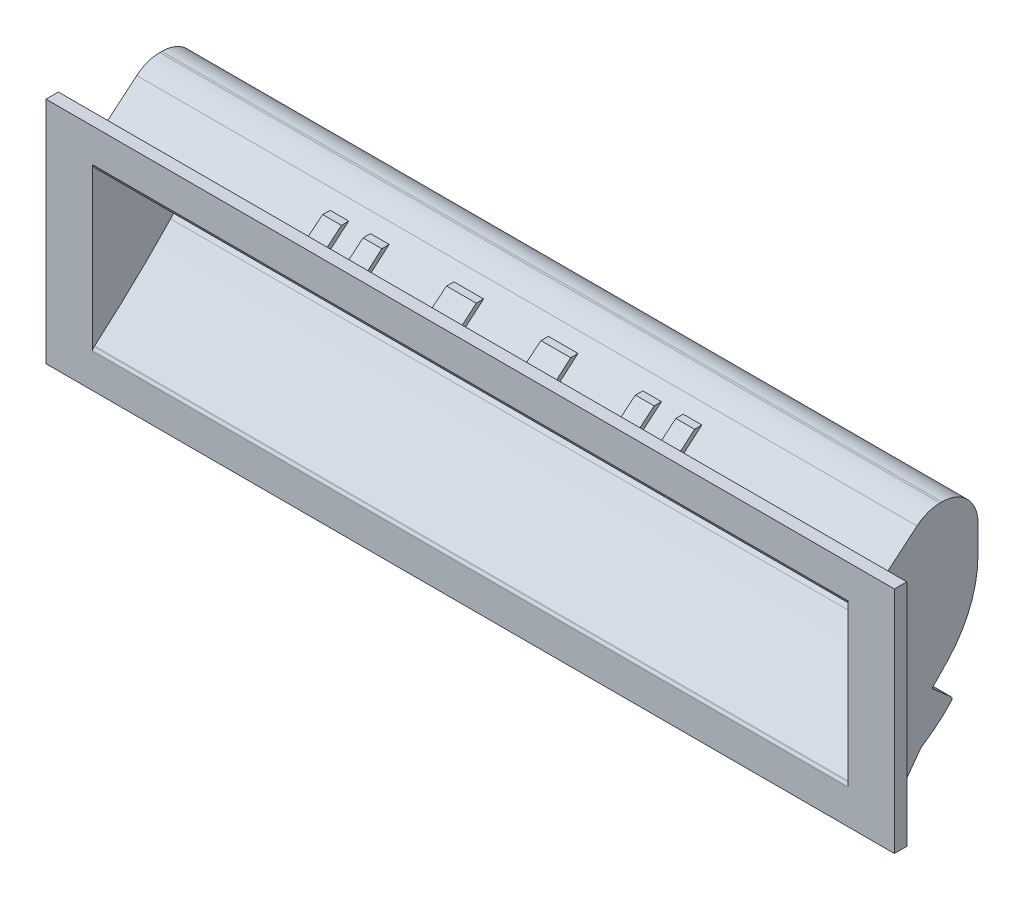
ISO-10303-21;
HEADER;
FILE_DESCRIPTION(('STEP AP214'),'2;1');
FILE_NAME('part.step','',(''),(''),'','','');
FILE_SCHEMA(('AUTOMOTIVE_DESIGN { 1 0 10303 214 1 1 1 1 }'));
ENDSEC;
DATA;
#1=APPLICATION_CONTEXT('core data for automotive mechanical design processes');
#2=APPLICATION_PROTOCOL_DEFINITION('international standard','automotive_design',2000,#1);
#3=PRODUCT_CONTEXT('',#1,'mechanical');
#4=PRODUCT('Part','Part','',(#3));
#5=PRODUCT_RELATED_PRODUCT_CATEGORY('part','',(#4));
#6=PRODUCT_DEFINITION_FORMATION('','',#4);
#7=PRODUCT_DEFINITION_CONTEXT('part definition',#1,'design');
#8=PRODUCT_DEFINITION('design','',#6,#7);
#9=PRODUCT_DEFINITION_SHAPE('','',#8);
#10=(LENGTH_UNIT() NAMED_UNIT(*) SI_UNIT(.MILLI.,.METRE.));
#11=(NAMED_UNIT(*) PLANE_ANGLE_UNIT() SI_UNIT($,.RADIAN.));
#12=(NAMED_UNIT(*) SI_UNIT($,.STERADIAN.) SOLID_ANGLE_UNIT());
#13=UNCERTAINTY_MEASURE_WITH_UNIT(LENGTH_MEASURE(1.E-05),#10,'distance_accuracy_value','');
#14=(GEOMETRIC_REPRESENTATION_CONTEXT(3) GLOBAL_UNCERTAINTY_ASSIGNED_CONTEXT((#13)) GLOBAL_UNIT_ASSIGNED_CONTEXT((#10,
#11,#12)) REPRESENTATION_CONTEXT('',''));
#15=CARTESIAN_POINT('',(0.,0.,0.));
#16=DIRECTION('',(0.,0.,1.));
#17=DIRECTION('',(1.,0.,0.));
#18=AXIS2_PLACEMENT_3D('',#15,#16,#17);
#19=CARTESIAN_POINT('',(63.,0.0539883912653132,-1.13094022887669));
#20=DIRECTION('',(1.,0.,0.));
#21=DIRECTION('',(0.,0.,-1.));
#22=AXIS2_PLACEMENT_3D('',#19,#20,#21);
#23=CYLINDRICAL_SURFACE('',#22,0.501000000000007);
#24=CARTESIAN_POINT('',(63.,0.0539883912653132,-1.13094022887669));
#25=DIRECTION('',(1.,0.,0.));
#26=DIRECTION('',(0.,0.,-1.));
#27=AXIS2_PLACEMENT_3D('',#24,#25,#26);
#28=CIRCLE('',#27,0.501000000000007);
#29=CARTESIAN_POINT('',(63.,-0.342750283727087,-0.824999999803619));
#30=VERTEX_POINT('',#29);
#31=CARTESIAN_POINT('',(63.,0.0462497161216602,-0.63));
#32=VERTEX_POINT('',#31);
#33=EDGE_CURVE('E631',#30,#32,#28,.F.);
#34=ORIENTED_EDGE('',*,*,#33,.T.);
#35=DIRECTION('',(1.,0.,0.));
#36=VECTOR('',#35,1.);
#37=CARTESIAN_POINT('',(63.,0.0462497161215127,-0.63));
#38=LINE('',#37,#36);
#39=CARTESIAN_POINT('',(-63.,0.046249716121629,-0.63));
#40=VERTEX_POINT('',#39);
#41=EDGE_CURVE('E511',#40,#32,#38,.T.);
#42=ORIENTED_EDGE('',*,*,#41,.F.);
#43=CARTESIAN_POINT('',(-63.,0.0539883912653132,-1.13094022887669));
#44=DIRECTION('',(1.,0.,0.));
#45=DIRECTION('',(0.,0.,-1.));
#46=AXIS2_PLACEMENT_3D('',#43,#44,#45);
#47=CIRCLE('',#46,0.501000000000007);
#48=CARTESIAN_POINT('',(-63.,-0.342750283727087,-0.824999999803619));
#49=VERTEX_POINT('',#48);
#50=EDGE_CURVE('E17',#40,#49,#47,.T.);
#51=ORIENTED_EDGE('',*,*,#50,.T.);
#52=DIRECTION('',(1.,0.,0.));
#53=VECTOR('',#52,1.);
#54=CARTESIAN_POINT('',(63.,-0.342750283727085,-0.824999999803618));
#55=LINE('',#54,#53);
#56=EDGE_CURVE('E505',#30,#49,#55,.F.);
#57=ORIENTED_EDGE('',*,*,#56,.F.);
#58=EDGE_LOOP('',(#34,#42,#51,#57));
#59=FACE_BOUND('',#58,.T.);
#60=ADVANCED_FACE('F14',(#59),#23,.T.);
#61=CARTESIAN_POINT('',(63.,-1.20135396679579,-3.97585910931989));
#62=DIRECTION('',(1.,0.,0.));
#63=DIRECTION('',(0.,0.,-1.));
#64=AXIS2_PLACEMENT_3D('',#61,#62,#63);
#65=CYLINDRICAL_SURFACE('',#64,0.499998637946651);
#66=CARTESIAN_POINT('',(63.,-1.20135396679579,-3.97585910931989));
#67=DIRECTION('',(1.,0.,0.));
#68=DIRECTION('',(0.,0.,-1.));
#69=AXIS2_PLACEMENT_3D('',#66,#67,#68);
#70=CIRCLE('',#69,0.499998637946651);
#71=CARTESIAN_POINT('',(63.,-1.49522987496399,-4.38037806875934));
#72=VERTEX_POINT('',#71);
#73=CARTESIAN_POINT('',(63.,-1.69375028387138,-3.88899999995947));
#74=VERTEX_POINT('',#73);
#75=EDGE_CURVE('E628',#72,#74,#70,.F.);
#76=ORIENTED_EDGE('',*,*,#75,.T.);
#77=DIRECTION('',(1.,0.,0.));
#78=VECTOR('',#77,1.);
#79=CARTESIAN_POINT('',(63.,-1.69375028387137,-3.88899999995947));
#80=LINE('',#79,#78);
#81=CARTESIAN_POINT('',(-63.,-1.69375028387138,-3.88899999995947));
#82=VERTEX_POINT('',#81);
#83=EDGE_CURVE('E508',#82,#74,#80,.T.);
#84=ORIENTED_EDGE('',*,*,#83,.F.);
#85=CARTESIAN_POINT('',(-63.,-1.20135396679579,-3.97585910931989));
#86=DIRECTION('',(1.,0.,0.));
#87=DIRECTION('',(0.,0.,-1.));
#88=AXIS2_PLACEMENT_3D('',#85,#86,#87);
#89=CIRCLE('',#88,0.499998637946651);
#90=CARTESIAN_POINT('',(-63.,-1.49522987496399,-4.38037806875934));
#91=VERTEX_POINT('',#90);
#92=EDGE_CURVE('E630',#82,#91,#89,.T.);
#93=ORIENTED_EDGE('',*,*,#92,.T.);
#94=DIRECTION('',(1.,0.,0.));
#95=VECTOR('',#94,1.);
#96=CARTESIAN_POINT('',(63.,-1.49522944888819,-4.3803783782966));
#97=LINE('',#96,#95);
#98=EDGE_CURVE('E499',#72,#91,#97,.F.);
#99=ORIENTED_EDGE('',*,*,#98,.F.);
#100=EDGE_LOOP('',(#76,#84,#93,#99));
#101=FACE_BOUND('',#100,.T.);
#102=ADVANCED_FACE('F648',(#101),#65,.T.);
#103=CARTESIAN_POINT('',(63.,1.70881342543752,-9.1801314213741));
#104=DIRECTION('',(1.,0.,0.));
#105=DIRECTION('',(0.,0.,-1.));
#106=AXIS2_PLACEMENT_3D('',#103,#104,#105);
#107=CYLINDRICAL_SURFACE('',#106,1.99999994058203);
#108=DIRECTION('',(1.,0.,0.));
#109=VECTOR('',#108,1.);
#110=CARTESIAN_POINT('',(63.,3.3862497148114,-8.09099999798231));
#111=LINE('',#110,#109);
#112=CARTESIAN_POINT('',(63.,3.38624971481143,-8.09099999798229));
#113=VERTEX_POINT('',#112);
#114=CARTESIAN_POINT('',(-63.,3.38624971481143,-8.09099999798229));
#115=VERTEX_POINT('',#114);
#116=EDGE_CURVE('E493',#113,#115,#111,.F.);
#117=ORIENTED_EDGE('',*,*,#116,.F.);
#118=CARTESIAN_POINT('',(63.,1.70881342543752,-9.1801314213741));
#119=DIRECTION('',(1.,0.,0.));
#120=DIRECTION('',(0.,0.,-1.));
#121=AXIS2_PLACEMENT_3D('',#118,#119,#120);
#122=CIRCLE('',#121,1.99999994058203);
#123=CARTESIAN_POINT('',(63.,2.88432192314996,-7.56205245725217));
#124=VERTEX_POINT('',#123);
#125=EDGE_CURVE('E626',#124,#113,#122,.F.);
#126=ORIENTED_EDGE('',*,*,#125,.F.);
#127=DIRECTION('',(1.,0.,0.));
#128=VECTOR('',#127,1.);
#129=CARTESIAN_POINT('',(63.,2.88432191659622,-7.56205245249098));
#130=LINE('',#129,#128);
#131=CARTESIAN_POINT('',(-63.,2.88432192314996,-7.56205245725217));
#132=VERTEX_POINT('',#131);
#133=EDGE_CURVE('E502',#132,#124,#130,.T.);
#134=ORIENTED_EDGE('',*,*,#133,.F.);
#135=CARTESIAN_POINT('',(-63.,1.70881342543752,-9.1801314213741));
#136=DIRECTION('',(1.,0.,0.));
#137=DIRECTION('',(0.,0.,-1.));
#138=AXIS2_PLACEMENT_3D('',#135,#136,#137);
#139=CIRCLE('',#138,1.99999994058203);
#140=EDGE_CURVE('E624',#115,#132,#139,.T.);
#141=ORIENTED_EDGE('',*,*,#140,.F.);
#142=EDGE_LOOP('',(#117,#126,#134,#141));
#143=FACE_BOUND('',#142,.T.);
#144=ADVANCED_FACE('F1011',(#143),#107,.F.);
#145=CARTESIAN_POINT('',(63.,7.54991593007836,-12.2879463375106));
#146=DIRECTION('',(1.,0.,0.));
#147=DIRECTION('',(0.,0.,-1.));
#148=AXIS2_PLACEMENT_3D('',#145,#146,#147);
#149=CYLINDRICAL_SURFACE('',#148,0.499999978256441);
#150=CARTESIAN_POINT('',(63.,7.54991593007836,-12.2879463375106));
#151=DIRECTION('',(1.,0.,0.));
#152=DIRECTION('',(0.,0.,-1.));
#153=AXIS2_PLACEMENT_3D('',#150,#151,#152);
#154=CIRCLE('',#153,0.499999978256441);
#155=CARTESIAN_POINT('',(63.,7.92732538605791,-12.6159129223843));
#156=VERTEX_POINT('',#155);
#157=CARTESIAN_POINT('',(63.,7.20824971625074,-12.6530000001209));
#158=VERTEX_POINT('',#157);
#159=EDGE_CURVE('E620',#156,#158,#154,.F.);
#160=ORIENTED_EDGE('',*,*,#159,.T.);
#161=DIRECTION('',(1.,0.,0.));
#162=VECTOR('',#161,1.);
#163=CARTESIAN_POINT('',(63.,7.2082497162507,-12.6530000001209));
#164=LINE('',#163,#162);
#165=CARTESIAN_POINT('',(-63.,7.20824971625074,-12.6530000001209));
#166=VERTEX_POINT('',#165);
#167=EDGE_CURVE('E496',#166,#158,#164,.T.);
#168=ORIENTED_EDGE('',*,*,#167,.F.);
#169=CARTESIAN_POINT('',(-63.,7.54991593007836,-12.2879463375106));
#170=DIRECTION('',(1.,0.,0.));
#171=DIRECTION('',(0.,0.,-1.));
#172=AXIS2_PLACEMENT_3D('',#169,#170,#171);
#173=CIRCLE('',#172,0.499999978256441);
#174=CARTESIAN_POINT('',(-63.,7.92732538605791,-12.6159129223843));
#175=VERTEX_POINT('',#174);
#176=EDGE_CURVE('E622',#166,#175,#173,.T.);
#177=ORIENTED_EDGE('',*,*,#176,.T.);
#178=DIRECTION('',(1.,0.,0.));
#179=VECTOR('',#178,1.);
#180=CARTESIAN_POINT('',(63.,7.92732539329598,-12.615912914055));
#181=LINE('',#180,#179);
#182=EDGE_CURVE('E487',#156,#175,#181,.F.);
#183=ORIENTED_EDGE('',*,*,#182,.F.);
#184=EDGE_LOOP('',(#160,#168,#177,#183));
#185=FACE_BOUND('',#184,.T.);
#186=ADVANCED_FACE('F1015',(#185),#149,.T.);
#187=CARTESIAN_POINT('',(63.,10.5923912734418,-9.8539816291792));
#188=DIRECTION('',(1.,0.,0.));
#189=DIRECTION('',(0.,0.,-1.));
#190=AXIS2_PLACEMENT_3D('',#187,#188,#189);
#191=CYLINDRICAL_SURFACE('',#190,0.199999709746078);
#192=DIRECTION('',(1.,0.,0.));
#193=VECTOR('',#192,1.);
#194=CARTESIAN_POINT('',(63.,10.7332497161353,-9.71200000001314));
#195=LINE('',#194,#193);
#196=CARTESIAN_POINT('',(63.,10.7332497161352,-9.71200000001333));
#197=VERTEX_POINT('',#196);
#198=CARTESIAN_POINT('',(-63.,10.7332497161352,-9.71200000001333));
#199=VERTEX_POINT('',#198);
#200=EDGE_CURVE('E484',#197,#199,#195,.F.);
#201=ORIENTED_EDGE('',*,*,#200,.F.);
#202=CARTESIAN_POINT('',(63.,10.5923912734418,-9.8539816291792));
#203=DIRECTION('',(1.,0.,0.));
#204=DIRECTION('',(0.,0.,-1.));
#205=AXIS2_PLACEMENT_3D('',#202,#203,#204);
#206=CIRCLE('',#205,0.199999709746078);
#207=CARTESIAN_POINT('',(63.,10.4414276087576,-9.72279528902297));
#208=VERTEX_POINT('',#207);
#209=EDGE_CURVE('E618',#208,#197,#206,.F.);
#210=ORIENTED_EDGE('',*,*,#209,.F.);
#211=DIRECTION('',(1.,0.,0.));
#212=VECTOR('',#211,1.);
#213=CARTESIAN_POINT('',(63.,10.4414275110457,-9.7227954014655));
#214=LINE('',#213,#212);
#215=CARTESIAN_POINT('',(-63.,10.4414276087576,-9.72279528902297));
#216=VERTEX_POINT('',#215);
#217=EDGE_CURVE('E490',#216,#208,#214,.T.);
#218=ORIENTED_EDGE('',*,*,#217,.F.);
#219=CARTESIAN_POINT('',(-63.,10.5923912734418,-9.8539816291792));
#220=DIRECTION('',(1.,0.,0.));
#221=DIRECTION('',(0.,0.,-1.));
#222=AXIS2_PLACEMENT_3D('',#219,#220,#221);
#223=CIRCLE('',#222,0.199999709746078);
#224=EDGE_CURVE('E522',#199,#216,#223,.T.);
#225=ORIENTED_EDGE('',*,*,#224,.F.);
#226=EDGE_LOOP('',(#201,#210,#218,#225));
#227=FACE_BOUND('',#226,.T.);
#228=ADVANCED_FACE('F768',(#227),#191,.F.);
#229=CARTESIAN_POINT('',(63.,35.8672497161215,-11.203));
#230=DIRECTION('',(0.,1.,0.));
#231=DIRECTION('',(0.,0.,1.));
#232=AXIS2_PLACEMENT_3D('',#229,#230,#231);
#233=PLANE('',#232);
#234=DIRECTION('',(0.,0.,1.));
#235=VECTOR('',#234,1.);
#236=CARTESIAN_POINT('',(63.,35.8672497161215,-11.203));
#237=LINE('',#236,#235);
#238=CARTESIAN_POINT('',(63.,35.8672497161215,-10.8856009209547));
#239=VERTEX_POINT('',#238);
#240=CARTESIAN_POINT('',(63.,35.8672497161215,-11.2030000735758));
#241=VERTEX_POINT('',#240);
#242=EDGE_CURVE('E517',#239,#241,#237,.F.);
#243=ORIENTED_EDGE('',*,*,#242,.T.);
#244=DIRECTION('',(1.,0.,0.));
#245=VECTOR('',#244,1.);
#246=CARTESIAN_POINT('',(63.,35.8672497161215,-11.203));
#247=LINE('',#246,#245);
#248=CARTESIAN_POINT('',(-63.,35.8672497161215,-11.2030000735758));
#249=VERTEX_POINT('',#248);
#250=EDGE_CURVE('E477',#249,#241,#247,.T.);
#251=ORIENTED_EDGE('',*,*,#250,.F.);
#252=DIRECTION('',(0.,0.,1.));
#253=VECTOR('',#252,1.);
#254=CARTESIAN_POINT('',(-63.,35.8672497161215,-11.203));
#255=LINE('',#254,#253);
#256=CARTESIAN_POINT('',(-63.,35.8672497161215,-10.8856009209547));
#257=VERTEX_POINT('',#256);
#258=EDGE_CURVE('E520',#249,#257,#255,.T.);
#259=ORIENTED_EDGE('',*,*,#258,.T.);
#260=DIRECTION('',(1.,0.,0.));
#261=VECTOR('',#260,1.);
#262=CARTESIAN_POINT('',(63.,35.8672497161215,-10.8856009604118));
#263=LINE('',#262,#261);
#264=EDGE_CURVE('E425',#239,#257,#263,.F.);
#265=ORIENTED_EDGE('',*,*,#264,.F.);
#266=EDGE_LOOP('',(#243,#251,#259,#265));
#267=FACE_BOUND('',#266,.T.);
#268=ADVANCED_FACE('F792',(#267),#233,.T.);
#269=CARTESIAN_POINT('',(63.,0.147249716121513,-0.63));
#270=DIRECTION('',(0.,0.,1.));
#271=DIRECTION('',(0.,-1.,0.));
#272=AXIS2_PLACEMENT_3D('',#269,#270,#271);
#273=PLANE('',#272);
#274=DIRECTION('',(0.,1.,0.));
#275=VECTOR('',#274,1.);
#276=CARTESIAN_POINT('',(63.,14.5322497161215,-0.63));
#277=LINE('',#276,#275);
#278=CARTESIAN_POINT('',(63.,0.147249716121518,-0.63));
#279=VERTEX_POINT('',#278);
#280=EDGE_CURVE('E526',#279,#32,#277,.F.);
#281=ORIENTED_EDGE('',*,*,#280,.F.);
#282=DIRECTION('',(1.,0.,0.));
#283=VECTOR('',#282,1.);
#284=CARTESIAN_POINT('',(63.,0.147249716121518,-0.63));
#285=LINE('',#284,#283);
#286=CARTESIAN_POINT('',(-63.,0.147249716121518,-0.63));
#287=VERTEX_POINT('',#286);
#288=EDGE_CURVE('E512',#287,#279,#285,.T.);
#289=ORIENTED_EDGE('',*,*,#288,.F.);
#290=DIRECTION('',(0.,-1.,0.));
#291=VECTOR('',#290,1.);
#292=CARTESIAN_POINT('',(-63.,0.147249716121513,-0.63));
#293=LINE('',#292,#291);
#294=EDGE_CURVE('E212',#287,#40,#293,.T.);
#295=ORIENTED_EDGE('',*,*,#294,.T.);
#296=ORIENTED_EDGE('',*,*,#41,.T.);
#297=EDGE_LOOP('',(#281,#289,#295,#296));
#298=FACE_BOUND('',#297,.T.);
#299=ADVANCED_FACE('F805',(#298),#273,.T.);
#300=CARTESIAN_POINT('',(63.,5.20179093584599,-5.09958344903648));
#301=DIRECTION('',(1.,0.,0.));
#302=DIRECTION('',(0.,0.,-1.));
#303=AXIS2_PLACEMENT_3D('',#300,#301,#302);
#304=CYLINDRICAL_SURFACE('',#303,7.001);
#305=CARTESIAN_POINT('',(63.,5.20179093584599,-5.09958344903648));
#306=DIRECTION('',(1.,0.,0.));
#307=DIRECTION('',(0.,0.,-1.));
#308=AXIS2_PLACEMENT_3D('',#305,#306,#307);
#309=CIRCLE('',#308,7.001);
#310=EDGE_CURVE('E614',#30,#74,#309,.T.);
#311=ORIENTED_EDGE('',*,*,#310,.F.);
#312=ORIENTED_EDGE('',*,*,#56,.T.);
#313=CARTESIAN_POINT('',(-63.,5.20179093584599,-5.09958344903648));
#314=DIRECTION('',(1.,0.,0.));
#315=DIRECTION('',(0.,0.,-1.));
#316=AXIS2_PLACEMENT_3D('',#313,#314,#315);
#317=CIRCLE('',#316,7.001);
#318=EDGE_CURVE('E593',#49,#82,#317,.T.);
#319=ORIENTED_EDGE('',*,*,#318,.T.);
#320=ORIENTED_EDGE('',*,*,#83,.T.);
#321=EDGE_LOOP('',(#311,#312,#319,#320));
#322=FACE_BOUND('',#321,.T.);
#323=ADVANCED_FACE('F640',(#322),#304,.T.);
#324=CARTESIAN_POINT('',(63.,-1.49522944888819,-4.3803783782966));
#325=DIRECTION('',(0.,-0.587754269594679,-0.80903950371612));
#326=DIRECTION('',(0.,0.80903950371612,-0.587754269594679));
#327=AXIS2_PLACEMENT_3D('',#324,#325,#326);
#328=PLANE('',#327);
#329=DIRECTION('',(0.,0.809039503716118,-0.587754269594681));
#330=VECTOR('',#329,1.);
#331=CARTESIAN_POINT('',(63.,-1.49522944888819,-4.3803783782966));
#332=LINE('',#331,#330);
#333=EDGE_CURVE('E613',#72,#124,#332,.T.);
#334=ORIENTED_EDGE('',*,*,#333,.F.);
#335=ORIENTED_EDGE('',*,*,#98,.T.);
#336=DIRECTION('',(0.,0.809039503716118,-0.587754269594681));
#337=VECTOR('',#336,1.);
#338=CARTESIAN_POINT('',(-63.,-1.49522944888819,-4.3803783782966));
#339=LINE('',#338,#337);
#340=EDGE_CURVE('E592',#91,#132,#339,.T.);
#341=ORIENTED_EDGE('',*,*,#340,.T.);
#342=ORIENTED_EDGE('',*,*,#133,.T.);
#343=EDGE_LOOP('',(#334,#335,#341,#342));
#344=FACE_BOUND('',#343,.T.);
#345=ADVANCED_FACE('F814',(#344),#328,.T.);
#346=CARTESIAN_POINT('',(63.,23.9808757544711,5.28096333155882));
#347=DIRECTION('',(1.,0.,0.));
#348=DIRECTION('',(0.,0.,-1.));
#349=AXIS2_PLACEMENT_3D('',#346,#347,#348);
#350=CYLINDRICAL_SURFACE('',#349,24.5550000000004);
#351=CARTESIAN_POINT('',(63.,23.9808757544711,5.28096333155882));
#352=DIRECTION('',(1.,0.,0.));
#353=DIRECTION('',(0.,0.,-1.));
#354=AXIS2_PLACEMENT_3D('',#351,#352,#353);
#355=CIRCLE('',#354,24.5550000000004);
#356=EDGE_CURVE('E610',#113,#158,#355,.T.);
#357=ORIENTED_EDGE('',*,*,#356,.F.);
#358=ORIENTED_EDGE('',*,*,#116,.T.);
#359=CARTESIAN_POINT('',(-63.,23.9808757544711,5.28096333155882));
#360=DIRECTION('',(1.,0.,0.));
#361=DIRECTION('',(0.,0.,-1.));
#362=AXIS2_PLACEMENT_3D('',#359,#360,#361);
#363=CIRCLE('',#362,24.5550000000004);
#364=EDGE_CURVE('E589',#115,#166,#363,.T.);
#365=ORIENTED_EDGE('',*,*,#364,.T.);
#366=ORIENTED_EDGE('',*,*,#167,.T.);
#367=EDGE_LOOP('',(#357,#358,#365,#366));
#368=FACE_BOUND('',#367,.T.);
#369=ADVANCED_FACE('F997',(#368),#350,.T.);
#370=CARTESIAN_POINT('',(63.,7.92732539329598,-12.615912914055));
#371=DIRECTION('',(0.,0.754818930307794,-0.655933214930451));
#372=DIRECTION('',(0.,0.655933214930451,0.754818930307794));
#373=AXIS2_PLACEMENT_3D('',#370,#371,#372);
#374=PLANE('',#373);
#375=DIRECTION('',(0.,0.655933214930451,0.754818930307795));
#376=VECTOR('',#375,1.);
#377=CARTESIAN_POINT('',(63.,7.92732539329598,-12.615912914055));
#378=LINE('',#377,#376);
#379=EDGE_CURVE('E609',#156,#208,#378,.T.);
#380=ORIENTED_EDGE('',*,*,#379,.F.);
#381=ORIENTED_EDGE('',*,*,#182,.T.);
#382=DIRECTION('',(0.,0.655933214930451,0.754818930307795));
#383=VECTOR('',#382,1.);
#384=CARTESIAN_POINT('',(-63.,7.92732539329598,-12.615912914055));
#385=LINE('',#384,#383);
#386=EDGE_CURVE('E588',#175,#216,#385,.T.);
#387=ORIENTED_EDGE('',*,*,#386,.T.);
#388=ORIENTED_EDGE('',*,*,#217,.T.);
#389=EDGE_LOOP('',(#380,#381,#387,#388));
#390=FACE_BOUND('',#389,.T.);
#391=ADVANCED_FACE('F764',(#390),#374,.T.);
#392=CARTESIAN_POINT('',(63.,124.63211254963,105.530222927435));
#393=DIRECTION('',(1.,0.,0.));
#394=DIRECTION('',(0.,0.,-1.));
#395=AXIS2_PLACEMENT_3D('',#392,#393,#394);
#396=CYLINDRICAL_SURFACE('',#395,162.030000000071);
#397=CARTESIAN_POINT('',(63.,124.63211254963,105.530222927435));
#398=DIRECTION('',(1.,0.,0.));
#399=DIRECTION('',(0.,0.,-1.));
#400=AXIS2_PLACEMENT_3D('',#397,#398,#399);
#401=CIRCLE('',#400,162.030000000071);
#402=CARTESIAN_POINT('',(63.,13.1642497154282,-12.0649999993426));
#403=VERTEX_POINT('',#402);
#404=EDGE_CURVE('E607',#197,#403,#401,.T.);
#405=ORIENTED_EDGE('',*,*,#404,.F.);
#406=ORIENTED_EDGE('',*,*,#200,.T.);
#407=CARTESIAN_POINT('',(-63.,124.63211254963,105.530222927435));
#408=DIRECTION('',(1.,0.,0.));
#409=DIRECTION('',(0.,0.,-1.));
#410=AXIS2_PLACEMENT_3D('',#407,#408,#409);
#411=CIRCLE('',#410,162.030000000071);
#412=CARTESIAN_POINT('',(-63.,13.1642497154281,-12.0649999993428));
#413=VERTEX_POINT('',#412);
#414=EDGE_CURVE('E585',#199,#413,#411,.T.);
#415=ORIENTED_EDGE('',*,*,#414,.T.);
#416=DIRECTION('',(1.,0.,0.));
#417=VECTOR('',#416,1.);
#418=CARTESIAN_POINT('',(63.,13.1642497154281,-12.0649999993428));
#419=LINE('',#418,#417);
#420=EDGE_CURVE('E482',#403,#413,#419,.F.);
#421=ORIENTED_EDGE('',*,*,#420,.F.);
#422=EDGE_LOOP('',(#405,#406,#415,#421));
#423=FACE_BOUND('',#422,.T.);
#424=ADVANCED_FACE('F773',(#423),#396,.T.);
#425=CARTESIAN_POINT('',(63.,25.551336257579,0.9989999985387));
#426=DIRECTION('',(1.,0.,0.));
#427=DIRECTION('',(0.,0.,-1.));
#428=AXIS2_PLACEMENT_3D('',#425,#426,#427);
#429=CYLINDRICAL_SURFACE('',#428,18.0029999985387);
#430=CARTESIAN_POINT('',(63.,25.551336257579,0.9989999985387));
#431=DIRECTION('',(1.,0.,0.));
#432=DIRECTION('',(0.,0.,-1.));
#433=AXIS2_PLACEMENT_3D('',#430,#431,#432);
#434=CIRCLE('',#433,18.0029999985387);
#435=CARTESIAN_POINT('',(63.,25.5513362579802,-17.004));
#436=VERTEX_POINT('',#435);
#437=EDGE_CURVE('E605',#403,#436,#434,.T.);
#438=ORIENTED_EDGE('',*,*,#437,.F.);
#439=ORIENTED_EDGE('',*,*,#420,.T.);
#440=CARTESIAN_POINT('',(-63.,25.551336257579,0.9989999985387));
#441=DIRECTION('',(1.,0.,0.));
#442=DIRECTION('',(0.,0.,-1.));
#443=AXIS2_PLACEMENT_3D('',#440,#441,#442);
#444=CIRCLE('',#443,18.0029999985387);
#445=CARTESIAN_POINT('',(-63.,25.5513362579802,-17.004));
#446=VERTEX_POINT('',#445);
#447=EDGE_CURVE('E582',#413,#446,#444,.T.);
#448=ORIENTED_EDGE('',*,*,#447,.T.);
#449=DIRECTION('',(-1.,0.,0.));
#450=VECTOR('',#449,1.);
#451=CARTESIAN_POINT('',(63.,25.5513362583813,-17.004));
#452=LINE('',#451,#450);
#453=EDGE_CURVE('E480',#436,#446,#452,.T.);
#454=ORIENTED_EDGE('',*,*,#453,.F.);
#455=EDGE_LOOP('',(#438,#439,#448,#454));
#456=FACE_BOUND('',#455,.T.);
#457=ADVANCED_FACE('F779',(#456),#429,.T.);
#458=CARTESIAN_POINT('',(63.,25.5513362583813,-17.004));
#459=DIRECTION('',(0.,0.,-1.));
#460=DIRECTION('',(-1.,0.,0.));
#461=AXIS2_PLACEMENT_3D('',#458,#459,#460);
#462=PLANE('',#461);
#463=DIRECTION('',(0.,1.,0.));
#464=VECTOR('',#463,1.);
#465=CARTESIAN_POINT('',(63.,14.5322497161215,-17.004));
#466=LINE('',#465,#464);
#467=CARTESIAN_POINT('',(63.,30.0662498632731,-17.004));
#468=VERTEX_POINT('',#467);
#469=EDGE_CURVE('E604',#436,#468,#466,.T.);
#470=ORIENTED_EDGE('',*,*,#469,.F.);
#471=ORIENTED_EDGE('',*,*,#453,.T.);
#472=DIRECTION('',(0.,1.,0.));
#473=VECTOR('',#472,1.);
#474=CARTESIAN_POINT('',(-63.,14.5322497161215,-17.004));
#475=LINE('',#474,#473);
#476=CARTESIAN_POINT('',(-63.,30.0662498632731,-17.004));
#477=VERTEX_POINT('',#476);
#478=EDGE_CURVE('E581',#446,#477,#475,.T.);
#479=ORIENTED_EDGE('',*,*,#478,.T.);
#480=DIRECTION('',(1.,0.,0.));
#481=VECTOR('',#480,1.);
#482=CARTESIAN_POINT('',(63.,30.0662498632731,-17.004));
#483=LINE('',#482,#481);
#484=EDGE_CURVE('E473',#468,#477,#483,.F.);
#485=ORIENTED_EDGE('',*,*,#484,.F.);
#486=EDGE_LOOP('',(#470,#471,#479,#485));
#487=FACE_BOUND('',#486,.T.);
#488=ADVANCED_FACE('F783',(#487),#462,.T.);
#489=CARTESIAN_POINT('',(63.,30.0662498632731,-11.2030001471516));
#490=DIRECTION('',(1.,0.,0.));
#491=DIRECTION('',(0.,0.,-1.));
#492=AXIS2_PLACEMENT_3D('',#489,#490,#491);
#493=CYLINDRICAL_SURFACE('',#492,5.80099985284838);
#494=CARTESIAN_POINT('',(63.,30.0662498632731,-11.2030001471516));
#495=DIRECTION('',(1.,0.,0.));
#496=DIRECTION('',(0.,0.,-1.));
#497=AXIS2_PLACEMENT_3D('',#494,#495,#496);
#498=CIRCLE('',#497,5.80099985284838);
#499=EDGE_CURVE('E601',#468,#241,#498,.T.);
#500=ORIENTED_EDGE('',*,*,#499,.F.);
#501=ORIENTED_EDGE('',*,*,#484,.T.);
#502=CARTESIAN_POINT('',(-63.,30.0662498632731,-11.2030001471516));
#503=DIRECTION('',(1.,0.,0.));
#504=DIRECTION('',(0.,0.,-1.));
#505=AXIS2_PLACEMENT_3D('',#502,#503,#504);
#506=CIRCLE('',#505,5.80099985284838);
#507=EDGE_CURVE('E578',#477,#249,#506,.T.);
#508=ORIENTED_EDGE('',*,*,#507,.T.);
#509=ORIENTED_EDGE('',*,*,#250,.T.);
#510=EDGE_LOOP('',(#500,#501,#508,#509));
#511=FACE_BOUND('',#510,.T.);
#512=ADVANCED_FACE('F787',(#511),#493,.T.);
#513=CARTESIAN_POINT('',(-20.5541121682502,14.5322497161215,-11.5749870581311));
#514=DIRECTION('',(0.999935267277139,0.,-0.0113781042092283));
#515=DIRECTION('',(-0.0113781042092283,0.,-0.999935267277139));
#516=AXIS2_PLACEMENT_3D('',#513,#514,#515);
#517=PLANE('',#516);
#518=DIRECTION('',(0.00871619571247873,-0.642781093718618,0.766000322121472));
#519=VECTOR('',#518,1.);
#520=CARTESIAN_POINT('',(-20.4837987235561,33.0322497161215,-5.39567178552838));
#521=LINE('',#520,#519);
#522=CARTESIAN_POINT('',(-20.4837987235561,33.0322497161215,-5.39567178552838));
#523=VERTEX_POINT('',#522);
#524=CARTESIAN_POINT('',(-20.4224022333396,28.504528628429,0.));
#525=VERTEX_POINT('',#524);
#526=EDGE_CURVE('E391',#523,#525,#521,.T.);
#527=ORIENTED_EDGE('',*,*,#526,.F.);
#528=DIRECTION('',(-0.0113781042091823,0.,-0.99993526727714));
#529=VECTOR('',#528,1.);
#530=CARTESIAN_POINT('',(-20.470238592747,33.0322497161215,-4.20397475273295));
#531=LINE('',#530,#529);
#532=CARTESIAN_POINT('',(-20.470238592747,33.0322497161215,-4.20397475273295));
#533=VERTEX_POINT('',#532);
#534=EDGE_CURVE('E385',#533,#523,#531,.T.);
#535=ORIENTED_EDGE('',*,*,#534,.F.);
#536=DIRECTION('',(0.00871619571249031,-0.642781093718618,0.766000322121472));
#537=VECTOR('',#536,1.);
#538=CARTESIAN_POINT('',(-20.470238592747,33.0322497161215,-4.20397475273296));
#539=LINE('',#538,#537);
#540=CARTESIAN_POINT('',(-20.4224022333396,29.504528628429,0.));
#541=VERTEX_POINT('',#540);
#542=EDGE_CURVE('E388',#533,#541,#539,.T.);
#543=ORIENTED_EDGE('',*,*,#542,.T.);
#544=DIRECTION('',(0.,1.,0.));
#545=VECTOR('',#544,1.);
#546=CARTESIAN_POINT('',(-20.4224022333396,14.5322497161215,0.));
#547=LINE('',#546,#545);
#548=EDGE_CURVE('E471',#541,#525,#547,.F.);
#549=ORIENTED_EDGE('',*,*,#548,.T.);
#550=EDGE_LOOP('',(#527,#535,#543,#549));
#551=FACE_BOUND('',#550,.T.);
#552=ADVANCED_FACE('F387',(#551),#517,.T.);
#553=CARTESIAN_POINT('',(-10.0761750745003,14.5322497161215,0.));
#554=DIRECTION('',(-0.999935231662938,0.,-0.0113812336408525));
#555=DIRECTION('',(-0.0113812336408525,0.,0.999935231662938));
#556=AXIS2_PLACEMENT_3D('',#553,#554,#555);
#557=PLANE('',#556);
#558=DIRECTION('',(0.00871859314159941,0.6427810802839,-0.766000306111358));
#559=VECTOR('',#558,1.);
#560=CARTESIAN_POINT('',(-10.0761750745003,28.504528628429,0.));
#561=LINE('',#560,#559);
#562=CARTESIAN_POINT('',(-10.0761750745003,28.504528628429,0.));
#563=VERTEX_POINT('',#562);
#564=CARTESIAN_POINT('',(-10.0147616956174,33.0322497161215,-5.39567178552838));
#565=VERTEX_POINT('',#564);
#566=EDGE_CURVE('E739',#563,#565,#561,.T.);
#567=ORIENTED_EDGE('',*,*,#566,.F.);
#568=DIRECTION('',(0.,1.,0.));
#569=VECTOR('',#568,1.);
#570=CARTESIAN_POINT('',(-10.0761750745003,14.5322497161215,0.));
#571=LINE('',#570,#569);
#572=CARTESIAN_POINT('',(-10.0761750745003,29.504528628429,0.));
#573=VERTEX_POINT('',#572);
#574=EDGE_CURVE('E469',#563,#573,#571,.T.);
#575=ORIENTED_EDGE('',*,*,#574,.T.);
#576=DIRECTION('',(0.00871859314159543,0.6427810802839,-0.766000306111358));
#577=VECTOR('',#576,1.);
#578=CARTESIAN_POINT('',(-10.0761750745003,29.504528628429,0.));
#579=LINE('',#578,#577);
#580=CARTESIAN_POINT('',(-10.0283255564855,33.0322497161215,-4.20397475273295));
#581=VERTEX_POINT('',#580);
#582=EDGE_CURVE('E683',#573,#581,#579,.T.);
#583=ORIENTED_EDGE('',*,*,#582,.T.);
#584=DIRECTION('',(-0.0113812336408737,0.,0.999935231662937));
#585=VECTOR('',#584,1.);
#586=CARTESIAN_POINT('',(-10.0147616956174,33.0322497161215,-5.39567178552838));
#587=LINE('',#586,#585);
#588=EDGE_CURVE('E467',#565,#581,#587,.T.);
#589=ORIENTED_EDGE('',*,*,#588,.F.);
#590=EDGE_LOOP('',(#567,#575,#583,#589));
#591=FACE_BOUND('',#590,.T.);
#592=ADVANCED_FACE('F980',(#591),#557,.T.);
#593=CARTESIAN_POINT('',(68.5,33.0322497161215,2.));
#594=DIRECTION('',(0.,1.,0.));
#595=DIRECTION('',(0.,0.,1.));
#596=AXIS2_PLACEMENT_3D('',#593,#594,#595);
#597=PLANE('',#596);
#598=DIRECTION('',(1.,0.,0.));
#599=VECTOR('',#598,1.);
#600=CARTESIAN_POINT('',(63.,33.0322497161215,-5.39567178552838));
#601=LINE('',#600,#599);
#602=CARTESIAN_POINT('',(-5.23556683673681,33.0322497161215,-5.39567178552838));
#603=VERTEX_POINT('',#602);
#604=EDGE_CURVE('E737',#565,#603,#601,.T.);
#605=ORIENTED_EDGE('',*,*,#604,.F.);
#606=ORIENTED_EDGE('',*,*,#588,.T.);
#607=DIRECTION('',(1.,0.,0.));
#608=VECTOR('',#607,1.);
#609=CARTESIAN_POINT('',(50.,33.0322497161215,-4.20397475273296));
#610=LINE('',#609,#608);
#611=CARTESIAN_POINT('',(-5.22200484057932,33.0322497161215,-4.20397475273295));
#612=VERTEX_POINT('',#611);
#613=EDGE_CURVE('E689',#581,#612,#610,.T.);
#614=ORIENTED_EDGE('',*,*,#613,.T.);
#615=DIRECTION('',(-0.0113796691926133,0.,-0.999935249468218));
#616=VECTOR('',#615,1.);
#617=CARTESIAN_POINT('',(-5.30588995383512,33.0322497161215,-11.5749870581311));
#618=LINE('',#617,#616);
#619=EDGE_CURVE('E463',#603,#612,#618,.F.);
#620=ORIENTED_EDGE('',*,*,#619,.F.);
#621=EDGE_LOOP('',(#605,#606,#614,#620));
#622=FACE_BOUND('',#621,.T.);
#623=ADVANCED_FACE('F976',(#622),#597,.T.);
#624=CARTESIAN_POINT('',(-5.30588995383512,14.5322497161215,-11.5749870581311));
#625=DIRECTION('',(0.999935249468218,0.,-0.0113796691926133));
#626=DIRECTION('',(-0.0113796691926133,0.,-0.999935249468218));
#627=AXIS2_PLACEMENT_3D('',#624,#625,#626);
#628=PLANE('',#627);
#629=DIRECTION('',(0.00871739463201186,-0.642781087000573,0.766000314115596));
#630=VECTOR('',#629,1.);
#631=CARTESIAN_POINT('',(-5.23556683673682,33.0322497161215,-5.39567178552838));
#632=LINE('',#631,#630);
#633=CARTESIAN_POINT('',(-5.17416190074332,28.504528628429,0.));
#634=VERTEX_POINT('',#633);
#635=EDGE_CURVE('E734',#603,#634,#632,.T.);
#636=ORIENTED_EDGE('',*,*,#635,.F.);
#637=ORIENTED_EDGE('',*,*,#619,.T.);
#638=DIRECTION('',(0.00871739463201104,-0.642781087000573,0.766000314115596));
#639=VECTOR('',#638,1.);
#640=CARTESIAN_POINT('',(-5.22200484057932,33.0322497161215,-4.20397475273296));
#641=LINE('',#640,#639);
#642=CARTESIAN_POINT('',(-5.17416190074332,29.504528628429,0.));
#643=VERTEX_POINT('',#642);
#644=EDGE_CURVE('E686',#612,#643,#641,.T.);
#645=ORIENTED_EDGE('',*,*,#644,.T.);
#646=DIRECTION('',(0.,1.,0.));
#647=VECTOR('',#646,1.);
#648=CARTESIAN_POINT('',(-5.17416190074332,14.5322497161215,0.));
#649=LINE('',#648,#647);
#650=EDGE_CURVE('E465',#643,#634,#649,.F.);
#651=ORIENTED_EDGE('',*,*,#650,.T.);
#652=EDGE_LOOP('',(#636,#637,#645,#651));
#653=FACE_BOUND('',#652,.T.);
#654=ADVANCED_FACE('F972',(#653),#628,.T.);
#655=CARTESIAN_POINT('',(5.17416190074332,14.5322497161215,0.));
#656=DIRECTION('',(-0.999935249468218,0.,-0.0113796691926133));
#657=DIRECTION('',(-0.0113796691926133,0.,0.999935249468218));
#658=AXIS2_PLACEMENT_3D('',#655,#656,#657);
#659=PLANE('',#658);
#660=DIRECTION('',(0.00871739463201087,0.642781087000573,-0.766000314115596));
#661=VECTOR('',#660,1.);
#662=CARTESIAN_POINT('',(5.17416190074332,28.504528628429,0.));
#663=LINE('',#662,#661);
#664=CARTESIAN_POINT('',(5.17416190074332,28.504528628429,0.));
#665=VERTEX_POINT('',#664);
#666=CARTESIAN_POINT('',(5.23556683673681,33.0322497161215,-5.39567178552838));
#667=VERTEX_POINT('',#666);
#668=EDGE_CURVE('E732',#665,#667,#663,.T.);
#669=ORIENTED_EDGE('',*,*,#668,.F.);
#670=DIRECTION('',(0.,1.,0.));
#671=VECTOR('',#670,1.);
#672=CARTESIAN_POINT('',(5.17416190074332,14.5322497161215,0.));
#673=LINE('',#672,#671);
#674=CARTESIAN_POINT('',(5.17416190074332,29.504528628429,0.));
#675=VERTEX_POINT('',#674);
#676=EDGE_CURVE('E461',#665,#675,#673,.T.);
#677=ORIENTED_EDGE('',*,*,#676,.T.);
#678=DIRECTION('',(0.00871739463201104,0.642781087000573,-0.766000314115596));
#679=VECTOR('',#678,1.);
#680=CARTESIAN_POINT('',(5.17416190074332,29.504528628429,0.));
#681=LINE('',#680,#679);
#682=CARTESIAN_POINT('',(5.22200484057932,33.0322497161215,-4.20397475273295));
#683=VERTEX_POINT('',#682);
#684=EDGE_CURVE('E674',#675,#683,#681,.T.);
#685=ORIENTED_EDGE('',*,*,#684,.T.);
#686=DIRECTION('',(-0.0113796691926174,0.,0.999935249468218));
#687=VECTOR('',#686,1.);
#688=CARTESIAN_POINT('',(5.23556683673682,33.0322497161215,-5.39567178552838));
#689=LINE('',#688,#687);
#690=EDGE_CURVE('E459',#667,#683,#689,.T.);
#691=ORIENTED_EDGE('',*,*,#690,.F.);
#692=EDGE_LOOP('',(#669,#677,#685,#691));
#693=FACE_BOUND('',#692,.T.);
#694=ADVANCED_FACE('F968',(#693),#659,.T.);
#695=CARTESIAN_POINT('',(68.5,33.0322497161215,2.));
#696=DIRECTION('',(0.,1.,0.));
#697=DIRECTION('',(0.,0.,1.));
#698=AXIS2_PLACEMENT_3D('',#695,#696,#697);
#699=PLANE('',#698);
#700=DIRECTION('',(1.,0.,0.));
#701=VECTOR('',#700,1.);
#702=CARTESIAN_POINT('',(63.,33.0322497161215,-5.39567178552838));
#703=LINE('',#702,#701);
#704=CARTESIAN_POINT('',(10.0147616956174,33.0322497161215,-5.39567178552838));
#705=VERTEX_POINT('',#704);
#706=EDGE_CURVE('E730',#667,#705,#703,.T.);
#707=ORIENTED_EDGE('',*,*,#706,.F.);
#708=ORIENTED_EDGE('',*,*,#690,.T.);
#709=DIRECTION('',(1.,0.,0.));
#710=VECTOR('',#709,1.);
#711=CARTESIAN_POINT('',(50.,33.0322497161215,-4.20397475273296));
#712=LINE('',#711,#710);
#713=CARTESIAN_POINT('',(10.0283255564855,33.0322497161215,-4.20397475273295));
#714=VERTEX_POINT('',#713);
#715=EDGE_CURVE('E680',#683,#714,#712,.T.);
#716=ORIENTED_EDGE('',*,*,#715,.T.);
#717=DIRECTION('',(-0.0113812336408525,0.,-0.999935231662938));
#718=VECTOR('',#717,1.);
#719=CARTESIAN_POINT('',(9.94442890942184,33.0322497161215,-11.5749870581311));
#720=LINE('',#719,#718);
#721=EDGE_CURVE('E455',#705,#714,#720,.F.);
#722=ORIENTED_EDGE('',*,*,#721,.F.);
#723=EDGE_LOOP('',(#707,#708,#716,#722));
#724=FACE_BOUND('',#723,.T.);
#725=ADVANCED_FACE('F964',(#724),#699,.T.);
#726=CARTESIAN_POINT('',(9.94442890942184,14.5322497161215,-11.5749870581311));
#727=DIRECTION('',(0.999935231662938,0.,-0.0113812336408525));
#728=DIRECTION('',(-0.0113812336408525,0.,-0.999935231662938));
#729=AXIS2_PLACEMENT_3D('',#726,#727,#728);
#730=PLANE('',#729);
#731=DIRECTION('',(0.0087185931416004,-0.6427810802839,0.766000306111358));
#732=VECTOR('',#731,1.);
#733=CARTESIAN_POINT('',(10.0147616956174,33.0322497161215,-5.39567178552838));
#734=LINE('',#733,#732);
#735=CARTESIAN_POINT('',(10.0761750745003,28.504528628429,0.));
#736=VERTEX_POINT('',#735);
#737=EDGE_CURVE('E727',#705,#736,#734,.T.);
#738=ORIENTED_EDGE('',*,*,#737,.F.);
#739=ORIENTED_EDGE('',*,*,#721,.T.);
#740=DIRECTION('',(0.00871859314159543,-0.6427810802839,0.766000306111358));
#741=VECTOR('',#740,1.);
#742=CARTESIAN_POINT('',(10.0283255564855,33.0322497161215,-4.20397475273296));
#743=LINE('',#742,#741);
#744=CARTESIAN_POINT('',(10.0761750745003,29.504528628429,0.));
#745=VERTEX_POINT('',#744);
#746=EDGE_CURVE('E677',#714,#745,#743,.T.);
#747=ORIENTED_EDGE('',*,*,#746,.T.);
#748=DIRECTION('',(0.,1.,0.));
#749=VECTOR('',#748,1.);
#750=CARTESIAN_POINT('',(10.0761750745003,14.5322497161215,0.));
#751=LINE('',#750,#749);
#752=EDGE_CURVE('E457',#745,#736,#751,.F.);
#753=ORIENTED_EDGE('',*,*,#752,.T.);
#754=EDGE_LOOP('',(#738,#739,#747,#753));
#755=FACE_BOUND('',#754,.T.);
#756=ADVANCED_FACE('F960',(#755),#730,.T.);
#757=CARTESIAN_POINT('',(20.4224022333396,14.5322497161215,0.));
#758=DIRECTION('',(-0.999935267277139,0.,-0.0113781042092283));
#759=DIRECTION('',(-0.0113781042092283,0.,0.999935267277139));
#760=AXIS2_PLACEMENT_3D('',#757,#758,#759);
#761=PLANE('',#760);
#762=DIRECTION('',(0.00871619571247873,0.642781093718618,-0.766000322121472));
#763=VECTOR('',#762,1.);
#764=CARTESIAN_POINT('',(20.4224022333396,28.504528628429,0.));
#765=LINE('',#764,#763);
#766=CARTESIAN_POINT('',(20.4224022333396,28.504528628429,0.));
#767=VERTEX_POINT('',#766);
#768=CARTESIAN_POINT('',(20.4837987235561,33.0322497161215,-5.39567178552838));
#769=VERTEX_POINT('',#768);
#770=EDGE_CURVE('E725',#767,#769,#765,.T.);
#771=ORIENTED_EDGE('',*,*,#770,.F.);
#772=DIRECTION('',(0.,1.,0.));
#773=VECTOR('',#772,1.);
#774=CARTESIAN_POINT('',(20.4224022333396,14.5322497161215,0.));
#775=LINE('',#774,#773);
#776=CARTESIAN_POINT('',(20.4224022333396,29.504528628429,0.));
#777=VERTEX_POINT('',#776);
#778=EDGE_CURVE('E453',#767,#777,#775,.T.);
#779=ORIENTED_EDGE('',*,*,#778,.T.);
#780=DIRECTION('',(0.00871619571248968,0.642781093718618,-0.766000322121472));
#781=VECTOR('',#780,1.);
#782=CARTESIAN_POINT('',(20.4224022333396,29.504528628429,0.));
#783=LINE('',#782,#781);
#784=CARTESIAN_POINT('',(20.470238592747,33.0322497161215,-4.20397475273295));
#785=VERTEX_POINT('',#784);
#786=EDGE_CURVE('E534',#777,#785,#783,.T.);
#787=ORIENTED_EDGE('',*,*,#786,.T.);
#788=DIRECTION('',(-0.0113781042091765,0.,0.99993526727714));
#789=VECTOR('',#788,1.);
#790=CARTESIAN_POINT('',(20.4837987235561,33.0322497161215,-5.39567178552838));
#791=LINE('',#790,#789);
#792=EDGE_CURVE('E451',#769,#785,#791,.T.);
#793=ORIENTED_EDGE('',*,*,#792,.F.);
#794=EDGE_LOOP('',(#771,#779,#787,#793));
#795=FACE_BOUND('',#794,.T.);
#796=ADVANCED_FACE('F956',(#795),#761,.T.);
#797=CARTESIAN_POINT('',(68.5,33.0322497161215,2.));
#798=DIRECTION('',(0.,1.,0.));
#799=DIRECTION('',(0.,0.,1.));
#800=AXIS2_PLACEMENT_3D('',#797,#798,#799);
#801=PLANE('',#800);
#802=DIRECTION('',(1.,0.,0.));
#803=VECTOR('',#802,1.);
#804=CARTESIAN_POINT('',(63.,33.0322497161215,-5.39567178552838));
#805=LINE('',#804,#803);
#806=CARTESIAN_POINT('',(23.5,33.0322497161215,-5.39567178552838));
#807=VERTEX_POINT('',#806);
#808=EDGE_CURVE('E723',#769,#807,#805,.T.);
#809=ORIENTED_EDGE('',*,*,#808,.F.);
#810=ORIENTED_EDGE('',*,*,#792,.T.);
#811=DIRECTION('',(1.,0.,0.));
#812=VECTOR('',#811,1.);
#813=CARTESIAN_POINT('',(50.,33.0322497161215,-4.20397475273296));
#814=LINE('',#813,#812);
#815=CARTESIAN_POINT('',(23.5,33.0322497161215,-4.20397475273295));
#816=VERTEX_POINT('',#815);
#817=EDGE_CURVE('E671',#785,#816,#814,.T.);
#818=ORIENTED_EDGE('',*,*,#817,.T.);
#819=DIRECTION('',(0.,0.,-1.));
#820=VECTOR('',#819,1.);
#821=CARTESIAN_POINT('',(23.5,33.0322497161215,-11.5749870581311));
#822=LINE('',#821,#820);
#823=EDGE_CURVE('E443',#807,#816,#822,.F.);
#824=ORIENTED_EDGE('',*,*,#823,.F.);
#825=EDGE_LOOP('',(#809,#810,#818,#824));
#826=FACE_BOUND('',#825,.T.);
#827=ADVANCED_FACE('F953',(#826),#801,.T.);
#828=CARTESIAN_POINT('',(23.5,14.5322497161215,-11.5749870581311));
#829=DIRECTION('',(1.,0.,0.));
#830=DIRECTION('',(0.,0.,-1.));
#831=AXIS2_PLACEMENT_3D('',#828,#829,#830);
#832=PLANE('',#831);
#833=DIRECTION('',(0.,-0.642805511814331,0.766029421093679));
#834=VECTOR('',#833,1.);
#835=CARTESIAN_POINT('',(23.5,34.5099863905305,-7.15668619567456));
#836=LINE('',#835,#834);
#837=CARTESIAN_POINT('',(23.5,28.504528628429,0.));
#838=VERTEX_POINT('',#837);
#839=EDGE_CURVE('E441',#807,#838,#836,.T.);
#840=ORIENTED_EDGE('',*,*,#839,.F.);
#841=ORIENTED_EDGE('',*,*,#823,.T.);
#842=DIRECTION('',(0.,0.642805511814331,-0.766029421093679));
#843=VECTOR('',#842,1.);
#844=CARTESIAN_POINT('',(23.5,29.504528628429,0.));
#845=LINE('',#844,#843);
#846=CARTESIAN_POINT('',(23.5,29.504528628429,0.));
#847=VERTEX_POINT('',#846);
#848=EDGE_CURVE('E669',#816,#847,#845,.F.);
#849=ORIENTED_EDGE('',*,*,#848,.T.);
#850=DIRECTION('',(0.,1.,0.));
#851=VECTOR('',#850,1.);
#852=CARTESIAN_POINT('',(23.5,14.5322497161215,0.));
#853=LINE('',#852,#851);
#854=EDGE_CURVE('E271',#847,#838,#853,.F.);
#855=ORIENTED_EDGE('',*,*,#854,.T.);
#856=EDGE_LOOP('',(#840,#841,#849,#855));
#857=FACE_BOUND('',#856,.T.);
#858=ADVANCED_FACE('F950',(#857),#832,.T.);
#859=CARTESIAN_POINT('',(27.,14.5322497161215,0.));
#860=DIRECTION('',(-1.,0.,0.));
#861=DIRECTION('',(0.,0.,1.));
#862=AXIS2_PLACEMENT_3D('',#859,#860,#861);
#863=PLANE('',#862);
#864=DIRECTION('',(0.,-0.642805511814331,0.766029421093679));
#865=VECTOR('',#864,1.);
#866=CARTESIAN_POINT('',(27.,34.5099863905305,-7.15668619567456));
#867=LINE('',#866,#865);
#868=CARTESIAN_POINT('',(27.,28.504528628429,0.));
#869=VERTEX_POINT('',#868);
#870=CARTESIAN_POINT('',(27.,33.0322497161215,-5.39567178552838));
#871=VERTEX_POINT('',#870);
#872=EDGE_CURVE('E438',#869,#871,#867,.F.);
#873=ORIENTED_EDGE('',*,*,#872,.F.);
#874=DIRECTION('',(0.,1.,0.));
#875=VECTOR('',#874,1.);
#876=CARTESIAN_POINT('',(27.,14.5322497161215,0.));
#877=LINE('',#876,#875);
#878=CARTESIAN_POINT('',(27.,29.504528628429,0.));
#879=VERTEX_POINT('',#878);
#880=EDGE_CURVE('E258',#869,#879,#877,.T.);
#881=ORIENTED_EDGE('',*,*,#880,.T.);
#882=DIRECTION('',(0.,0.642805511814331,-0.766029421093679));
#883=VECTOR('',#882,1.);
#884=CARTESIAN_POINT('',(27.,29.504528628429,0.));
#885=LINE('',#884,#883);
#886=CARTESIAN_POINT('',(27.,33.0322497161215,-4.20397475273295));
#887=VERTEX_POINT('',#886);
#888=EDGE_CURVE('E530',#879,#887,#885,.T.);
#889=ORIENTED_EDGE('',*,*,#888,.T.);
#890=DIRECTION('',(0.,0.,1.));
#891=VECTOR('',#890,1.);
#892=CARTESIAN_POINT('',(27.,33.0322497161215,2.));
#893=LINE('',#892,#891);
#894=EDGE_CURVE('E433',#871,#887,#893,.T.);
#895=ORIENTED_EDGE('',*,*,#894,.F.);
#896=EDGE_LOOP('',(#873,#881,#889,#895));
#897=FACE_BOUND('',#896,.T.);
#898=ADVANCED_FACE('F946',(#897),#863,.T.);
#899=CARTESIAN_POINT('',(68.5,33.0322497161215,2.));
#900=DIRECTION('',(0.,1.,0.));
#901=DIRECTION('',(0.,0.,1.));
#902=AXIS2_PLACEMENT_3D('',#899,#900,#901);
#903=PLANE('',#902);
#904=DIRECTION('',(1.,0.,0.));
#905=VECTOR('',#904,1.);
#906=CARTESIAN_POINT('',(63.,33.0322497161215,-5.39567178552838));
#907=LINE('',#906,#905);
#908=CARTESIAN_POINT('',(30.0183733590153,33.0322497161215,-5.39567178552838));
#909=VERTEX_POINT('',#908);
#910=EDGE_CURVE('E435',#871,#909,#907,.T.);
#911=ORIENTED_EDGE('',*,*,#910,.F.);
#912=ORIENTED_EDGE('',*,*,#894,.T.);
#913=DIRECTION('',(1.,0.,0.));
#914=VECTOR('',#913,1.);
#915=CARTESIAN_POINT('',(50.,33.0322497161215,-4.20397475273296));
#916=LINE('',#915,#914);
#917=CARTESIAN_POINT('',(30.0319396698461,33.0322497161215,-4.20397475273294));
#918=VERTEX_POINT('',#917);
#919=EDGE_CURVE('E527',#887,#918,#916,.T.);
#920=ORIENTED_EDGE('',*,*,#919,.T.);
#921=DIRECTION('',(-0.0113832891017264,0.,-0.999935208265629));
#922=VECTOR('',#921,1.);
#923=CARTESIAN_POINT('',(29.9480278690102,33.0322497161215,-11.5749870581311));
#924=LINE('',#923,#922);
#925=EDGE_CURVE('E432',#909,#918,#924,.F.);
#926=ORIENTED_EDGE('',*,*,#925,.F.);
#927=EDGE_LOOP('',(#911,#912,#920,#926));
#928=FACE_BOUND('',#927,.T.);
#929=ADVANCED_FACE('F942',(#928),#903,.T.);
#930=CARTESIAN_POINT('',(29.9480278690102,14.5322497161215,-11.5749870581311));
#931=DIRECTION('',(0.999935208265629,0.,-0.0113832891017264));
#932=DIRECTION('',(-0.0113832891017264,0.,-0.999935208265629));
#933=AXIS2_PLACEMENT_3D('',#930,#931,#932);
#934=PLANE('',#933);
#935=DIRECTION('',(0.00872016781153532,-0.642781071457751,0.766000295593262));
#936=VECTOR('',#935,1.);
#937=CARTESIAN_POINT('',(30.0183733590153,33.0322497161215,-5.39567178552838));
#938=LINE('',#937,#936);
#939=CARTESIAN_POINT('',(30.079797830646,28.504528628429,0.));
#940=VERTEX_POINT('',#939);
#941=EDGE_CURVE('E437',#909,#940,#938,.T.);
#942=ORIENTED_EDGE('',*,*,#941,.F.);
#943=ORIENTED_EDGE('',*,*,#925,.T.);
#944=DIRECTION('',(0.0087201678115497,-0.642781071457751,0.766000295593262));
#945=VECTOR('',#944,1.);
#946=CARTESIAN_POINT('',(30.031939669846,33.0322497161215,-4.20397475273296));
#947=LINE('',#946,#945);
#948=CARTESIAN_POINT('',(30.079797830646,29.504528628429,0.));
#949=VERTEX_POINT('',#948);
#950=EDGE_CURVE('E523',#918,#949,#947,.T.);
#951=ORIENTED_EDGE('',*,*,#950,.T.);
#952=DIRECTION('',(0.,1.,0.));
#953=VECTOR('',#952,1.);
#954=CARTESIAN_POINT('',(30.079797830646,14.5322497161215,0.));
#955=LINE('',#954,#953);
#956=EDGE_CURVE('E430',#949,#940,#955,.F.);
#957=ORIENTED_EDGE('',*,*,#956,.T.);
#958=EDGE_LOOP('',(#942,#943,#951,#957));
#959=FACE_BOUND('',#958,.T.);
#960=ADVANCED_FACE('F939',(#959),#934,.T.);
#961=CARTESIAN_POINT('',(63.,30.0662499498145,-10.8856008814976));
#962=DIRECTION('',(1.,0.,0.));
#963=DIRECTION('',(0.,0.,-1.));
#964=AXIS2_PLACEMENT_3D('',#961,#962,#963);
#965=CYLINDRICAL_SURFACE('',#964,5.80099976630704);
#966=CARTESIAN_POINT('',(63.,30.0662499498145,-10.8856008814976));
#967=DIRECTION('',(1.,0.,0.));
#968=DIRECTION('',(0.,0.,-1.));
#969=AXIS2_PLACEMENT_3D('',#966,#967,#968);
#970=CIRCLE('',#969,5.80099976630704);
#971=CARTESIAN_POINT('',(63.,34.5099864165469,-7.15668622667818));
#972=VERTEX_POINT('',#971);
#973=EDGE_CURVE('E515',#239,#972,#970,.T.);
#974=ORIENTED_EDGE('',*,*,#973,.F.);
#975=ORIENTED_EDGE('',*,*,#264,.T.);
#976=CARTESIAN_POINT('',(-63.,30.0662499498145,-10.8856008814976));
#977=DIRECTION('',(1.,0.,0.));
#978=DIRECTION('',(0.,0.,-1.));
#979=AXIS2_PLACEMENT_3D('',#976,#977,#978);
#980=CIRCLE('',#979,5.80099976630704);
#981=CARTESIAN_POINT('',(-63.,34.5099864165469,-7.15668622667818));
#982=VERTEX_POINT('',#981);
#983=EDGE_CURVE('E575',#257,#982,#980,.T.);
#984=ORIENTED_EDGE('',*,*,#983,.T.);
#985=DIRECTION('',(1.,0.,0.));
#986=VECTOR('',#985,1.);
#987=CARTESIAN_POINT('',(63.,34.5099863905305,-7.15668619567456));
#988=LINE('',#987,#986);
#989=EDGE_CURVE('E426',#972,#982,#988,.F.);
#990=ORIENTED_EDGE('',*,*,#989,.F.);
#991=EDGE_LOOP('',(#974,#975,#984,#990));
#992=FACE_BOUND('',#991,.T.);
#993=ADVANCED_FACE('F796',(#992),#965,.T.);
#994=CARTESIAN_POINT('',(-30.079797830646,14.5322497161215,0.));
#995=DIRECTION('',(-0.999935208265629,0.,-0.0113832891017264));
#996=DIRECTION('',(-0.0113832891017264,0.,0.999935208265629));
#997=AXIS2_PLACEMENT_3D('',#994,#995,#996);
#998=PLANE('',#997);
#999=DIRECTION('',(0.00872016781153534,0.642781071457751,-0.766000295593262));
#1000=VECTOR('',#999,1.);
#1001=CARTESIAN_POINT('',(-30.079797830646,28.504528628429,0.));
#1002=LINE('',#1001,#1000);
#1003=CARTESIAN_POINT('',(-30.079797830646,28.504528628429,0.));
#1004=VERTEX_POINT('',#1003);
#1005=CARTESIAN_POINT('',(-30.0183733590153,33.0322497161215,-5.39567178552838));
#1006=VERTEX_POINT('',#1005);
#1007=EDGE_CURVE('E720',#1004,#1006,#1002,.T.);
#1008=ORIENTED_EDGE('',*,*,#1007,.F.);
#1009=DIRECTION('',(0.,1.,0.));
#1010=VECTOR('',#1009,1.);
#1011=CARTESIAN_POINT('',(-30.079797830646,14.5322497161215,0.));
#1012=LINE('',#1011,#1010);
#1013=CARTESIAN_POINT('',(-30.079797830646,29.504528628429,0.));
#1014=VERTEX_POINT('',#1013);
#1015=EDGE_CURVE('E423',#1004,#1014,#1012,.T.);
#1016=ORIENTED_EDGE('',*,*,#1015,.T.);
#1017=DIRECTION('',(0.00872016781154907,0.642781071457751,-0.766000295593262));
#1018=VECTOR('',#1017,1.);
#1019=CARTESIAN_POINT('',(-30.079797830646,29.504528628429,0.));
#1020=LINE('',#1019,#1018);
#1021=CARTESIAN_POINT('',(-30.031939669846,33.0322497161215,-4.20397475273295));
#1022=VERTEX_POINT('',#1021);
#1023=EDGE_CURVE('E405',#1014,#1022,#1020,.T.);
#1024=ORIENTED_EDGE('',*,*,#1023,.T.);
#1025=DIRECTION('',(-0.0113832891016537,0.,0.99993520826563));
#1026=VECTOR('',#1025,1.);
#1027=CARTESIAN_POINT('',(-30.0183733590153,33.0322497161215,-5.39567178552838));
#1028=LINE('',#1027,#1026);
#1029=EDGE_CURVE('E221',#1006,#1022,#1028,.T.);
#1030=ORIENTED_EDGE('',*,*,#1029,.F.);
#1031=EDGE_LOOP('',(#1008,#1016,#1024,#1030));
#1032=FACE_BOUND('',#1031,.T.);
#1033=ADVANCED_FACE('F933',(#1032),#998,.T.);
#1034=CARTESIAN_POINT('',(68.5,33.0322497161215,2.));
#1035=DIRECTION('',(0.,1.,0.));
#1036=DIRECTION('',(0.,0.,1.));
#1037=AXIS2_PLACEMENT_3D('',#1034,#1035,#1036);
#1038=PLANE('',#1037);
#1039=DIRECTION('',(1.,0.,0.));
#1040=VECTOR('',#1039,1.);
#1041=CARTESIAN_POINT('',(63.,33.0322497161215,-5.39567178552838));
#1042=LINE('',#1041,#1040);
#1043=CARTESIAN_POINT('',(-27.,33.0322497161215,-5.39567178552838));
#1044=VERTEX_POINT('',#1043);
#1045=EDGE_CURVE('E718',#1006,#1044,#1042,.T.);
#1046=ORIENTED_EDGE('',*,*,#1045,.F.);
#1047=ORIENTED_EDGE('',*,*,#1029,.T.);
#1048=DIRECTION('',(1.,0.,0.));
#1049=VECTOR('',#1048,1.);
#1050=CARTESIAN_POINT('',(50.,33.0322497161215,-4.20397475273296));
#1051=LINE('',#1050,#1049);
#1052=CARTESIAN_POINT('',(-27.,33.0322497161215,-4.20397475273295));
#1053=VERTEX_POINT('',#1052);
#1054=EDGE_CURVE('E414',#1022,#1053,#1051,.T.);
#1055=ORIENTED_EDGE('',*,*,#1054,.T.);
#1056=DIRECTION('',(0.,0.,-1.));
#1057=VECTOR('',#1056,1.);
#1058=CARTESIAN_POINT('',(-27.,33.0322497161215,-11.5749870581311));
#1059=LINE('',#1058,#1057);
#1060=EDGE_CURVE('E418',#1044,#1053,#1059,.F.);
#1061=ORIENTED_EDGE('',*,*,#1060,.F.);
#1062=EDGE_LOOP('',(#1046,#1047,#1055,#1061));
#1063=FACE_BOUND('',#1062,.T.);
#1064=ADVANCED_FACE('F929',(#1063),#1038,.T.);
#1065=CARTESIAN_POINT('',(-27.,14.5322497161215,-11.5749870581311));
#1066=DIRECTION('',(1.,0.,0.));
#1067=DIRECTION('',(0.,0.,-1.));
#1068=AXIS2_PLACEMENT_3D('',#1065,#1066,#1067);
#1069=PLANE('',#1068);
#1070=DIRECTION('',(0.,-0.642805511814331,0.766029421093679));
#1071=VECTOR('',#1070,1.);
#1072=CARTESIAN_POINT('',(-27.,34.5099863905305,-7.15668619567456));
#1073=LINE('',#1072,#1071);
#1074=CARTESIAN_POINT('',(-27.,28.504528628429,0.));
#1075=VERTEX_POINT('',#1074);
#1076=EDGE_CURVE('E715',#1044,#1075,#1073,.T.);
#1077=ORIENTED_EDGE('',*,*,#1076,.F.);
#1078=ORIENTED_EDGE('',*,*,#1060,.T.);
#1079=DIRECTION('',(0.,0.642805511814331,-0.766029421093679));
#1080=VECTOR('',#1079,1.);
#1081=CARTESIAN_POINT('',(-27.,29.504528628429,0.));
#1082=LINE('',#1081,#1080);
#1083=CARTESIAN_POINT('',(-27.,29.504528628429,0.));
#1084=VERTEX_POINT('',#1083);
#1085=EDGE_CURVE('E408',#1053,#1084,#1082,.F.);
#1086=ORIENTED_EDGE('',*,*,#1085,.T.);
#1087=DIRECTION('',(0.,1.,0.));
#1088=VECTOR('',#1087,1.);
#1089=CARTESIAN_POINT('',(-27.,14.5322497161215,0.));
#1090=LINE('',#1089,#1088);
#1091=EDGE_CURVE('E420',#1084,#1075,#1090,.F.);
#1092=ORIENTED_EDGE('',*,*,#1091,.T.);
#1093=EDGE_LOOP('',(#1077,#1078,#1086,#1092));
#1094=FACE_BOUND('',#1093,.T.);
#1095=ADVANCED_FACE('F926',(#1094),#1069,.T.);
#1096=CARTESIAN_POINT('',(-23.5,14.5322497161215,0.));
#1097=DIRECTION('',(-1.,0.,0.));
#1098=DIRECTION('',(0.,0.,1.));
#1099=AXIS2_PLACEMENT_3D('',#1096,#1097,#1098);
#1100=PLANE('',#1099);
#1101=DIRECTION('',(0.,-0.642805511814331,0.766029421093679));
#1102=VECTOR('',#1101,1.);
#1103=CARTESIAN_POINT('',(-23.5,34.5099863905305,-7.15668619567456));
#1104=LINE('',#1103,#1102);
#1105=CARTESIAN_POINT('',(-23.5,28.504528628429,0.));
#1106=VERTEX_POINT('',#1105);
#1107=CARTESIAN_POINT('',(-23.5,33.0322497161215,-5.39567178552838));
#1108=VERTEX_POINT('',#1107);
#1109=EDGE_CURVE('E713',#1106,#1108,#1104,.F.);
#1110=ORIENTED_EDGE('',*,*,#1109,.F.);
#1111=DIRECTION('',(0.,1.,0.));
#1112=VECTOR('',#1111,1.);
#1113=CARTESIAN_POINT('',(-23.5,14.5322497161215,0.));
#1114=LINE('',#1113,#1112);
#1115=CARTESIAN_POINT('',(-23.5,29.504528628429,0.));
#1116=VERTEX_POINT('',#1115);
#1117=EDGE_CURVE('E393',#1106,#1116,#1114,.T.);
#1118=ORIENTED_EDGE('',*,*,#1117,.T.);
#1119=DIRECTION('',(0.,0.642805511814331,-0.766029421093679));
#1120=VECTOR('',#1119,1.);
#1121=CARTESIAN_POINT('',(-23.5,29.504528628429,0.));
#1122=LINE('',#1121,#1120);
#1123=CARTESIAN_POINT('',(-23.5,33.0322497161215,-4.20397475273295));
#1124=VERTEX_POINT('',#1123);
#1125=EDGE_CURVE('E402',#1116,#1124,#1122,.T.);
#1126=ORIENTED_EDGE('',*,*,#1125,.T.);
#1127=DIRECTION('',(0.,0.,1.));
#1128=VECTOR('',#1127,1.);
#1129=CARTESIAN_POINT('',(-23.5,33.0322497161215,2.));
#1130=LINE('',#1129,#1128);
#1131=EDGE_CURVE('E379',#1108,#1124,#1130,.T.);
#1132=ORIENTED_EDGE('',*,*,#1131,.F.);
#1133=EDGE_LOOP('',(#1110,#1118,#1126,#1132));
#1134=FACE_BOUND('',#1133,.T.);
#1135=ADVANCED_FACE('F693',(#1134),#1100,.T.);
#1136=CARTESIAN_POINT('',(68.5,33.0322497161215,2.));
#1137=DIRECTION('',(0.,1.,0.));
#1138=DIRECTION('',(0.,0.,1.));
#1139=AXIS2_PLACEMENT_3D('',#1136,#1137,#1138);
#1140=PLANE('',#1139);
#1141=DIRECTION('',(1.,0.,0.));
#1142=VECTOR('',#1141,1.);
#1143=CARTESIAN_POINT('',(63.,33.0322497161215,-5.39567178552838));
#1144=LINE('',#1143,#1142);
#1145=EDGE_CURVE('E711',#1108,#523,#1144,.T.);
#1146=ORIENTED_EDGE('',*,*,#1145,.F.);
#1147=ORIENTED_EDGE('',*,*,#1131,.T.);
#1148=DIRECTION('',(1.,0.,0.));
#1149=VECTOR('',#1148,1.);
#1150=CARTESIAN_POINT('',(50.,33.0322497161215,-4.20397475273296));
#1151=LINE('',#1150,#1149);
#1152=EDGE_CURVE('E398',#1124,#533,#1151,.T.);
#1153=ORIENTED_EDGE('',*,*,#1152,.T.);
#1154=ORIENTED_EDGE('',*,*,#534,.T.);
#1155=EDGE_LOOP('',(#1146,#1147,#1153,#1154));
#1156=FACE_BOUND('',#1155,.T.);
#1157=ADVANCED_FACE('F404',(#1156),#1140,.T.);
#1158=CARTESIAN_POINT('',(50.,29.504528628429,0.));
#1159=DIRECTION('',(0.,-0.766029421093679,-0.642805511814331));
#1160=DIRECTION('',(0.,0.642805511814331,-0.766029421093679));
#1161=AXIS2_PLACEMENT_3D('',#1158,#1159,#1160);
#1162=PLANE('',#1161);
#1163=DIRECTION('',(1.,0.,0.));
#1164=VECTOR('',#1163,1.);
#1165=CARTESIAN_POINT('',(0.,29.504528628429,0.));
#1166=LINE('',#1165,#1164);
#1167=EDGE_CURVE('E705',#1014,#1084,#1166,.T.);
#1168=ORIENTED_EDGE('',*,*,#1167,.T.);
#1169=ORIENTED_EDGE('',*,*,#1085,.F.);
#1170=ORIENTED_EDGE('',*,*,#1054,.F.);
#1171=ORIENTED_EDGE('',*,*,#1023,.F.);
#1172=EDGE_LOOP('',(#1168,#1169,#1170,#1171));
#1173=FACE_BOUND('',#1172,.T.);
#1174=ADVANCED_FACE('F918',(#1173),#1162,.F.);
#1175=CARTESIAN_POINT('',(50.,29.504528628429,0.));
#1176=DIRECTION('',(0.,-0.766029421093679,-0.642805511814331));
#1177=DIRECTION('',(0.,0.642805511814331,-0.766029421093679));
#1178=AXIS2_PLACEMENT_3D('',#1175,#1176,#1177);
#1179=PLANE('',#1178);
#1180=DIRECTION('',(1.,0.,0.));
#1181=VECTOR('',#1180,1.);
#1182=CARTESIAN_POINT('',(0.,29.504528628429,0.));
#1183=LINE('',#1182,#1181);
#1184=EDGE_CURVE('E401',#1116,#541,#1183,.T.);
#1185=ORIENTED_EDGE('',*,*,#1184,.T.);
#1186=ORIENTED_EDGE('',*,*,#542,.F.);
#1187=ORIENTED_EDGE('',*,*,#1152,.F.);
#1188=ORIENTED_EDGE('',*,*,#1125,.F.);
#1189=EDGE_LOOP('',(#1185,#1186,#1187,#1188));
#1190=FACE_BOUND('',#1189,.T.);
#1191=ADVANCED_FACE('F396',(#1190),#1179,.F.);
#1192=CARTESIAN_POINT('',(50.,29.504528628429,0.));
#1193=DIRECTION('',(0.,-0.766029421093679,-0.642805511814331));
#1194=DIRECTION('',(0.,0.642805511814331,-0.766029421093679));
#1195=AXIS2_PLACEMENT_3D('',#1192,#1193,#1194);
#1196=PLANE('',#1195);
#1197=DIRECTION('',(1.,0.,0.));
#1198=VECTOR('',#1197,1.);
#1199=CARTESIAN_POINT('',(0.,29.504528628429,0.));
#1200=LINE('',#1199,#1198);
#1201=EDGE_CURVE('E702',#573,#643,#1200,.T.);
#1202=ORIENTED_EDGE('',*,*,#1201,.T.);
#1203=ORIENTED_EDGE('',*,*,#644,.F.);
#1204=ORIENTED_EDGE('',*,*,#613,.F.);
#1205=ORIENTED_EDGE('',*,*,#582,.F.);
#1206=EDGE_LOOP('',(#1202,#1203,#1204,#1205));
#1207=FACE_BOUND('',#1206,.T.);
#1208=ADVANCED_FACE('F911',(#1207),#1196,.F.);
#1209=CARTESIAN_POINT('',(50.,29.504528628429,0.));
#1210=DIRECTION('',(0.,-0.766029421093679,-0.642805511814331));
#1211=DIRECTION('',(0.,0.642805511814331,-0.766029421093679));
#1212=AXIS2_PLACEMENT_3D('',#1209,#1210,#1211);
#1213=PLANE('',#1212);
#1214=DIRECTION('',(1.,0.,0.));
#1215=VECTOR('',#1214,1.);
#1216=CARTESIAN_POINT('',(0.,29.504528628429,0.));
#1217=LINE('',#1216,#1215);
#1218=EDGE_CURVE('E1404',#675,#745,#1217,.T.);
#1219=ORIENTED_EDGE('',*,*,#1218,.T.);
#1220=ORIENTED_EDGE('',*,*,#746,.F.);
#1221=ORIENTED_EDGE('',*,*,#715,.F.);
#1222=ORIENTED_EDGE('',*,*,#684,.F.);
#1223=EDGE_LOOP('',(#1219,#1220,#1221,#1222));
#1224=FACE_BOUND('',#1223,.T.);
#1225=ADVANCED_FACE('F907',(#1224),#1213,.F.);
#1226=CARTESIAN_POINT('',(50.,29.504528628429,0.));
#1227=DIRECTION('',(0.,-0.766029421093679,-0.642805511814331));
#1228=DIRECTION('',(0.,0.642805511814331,-0.766029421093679));
#1229=AXIS2_PLACEMENT_3D('',#1226,#1227,#1228);
#1230=PLANE('',#1229);
#1231=DIRECTION('',(1.,0.,0.));
#1232=VECTOR('',#1231,1.);
#1233=CARTESIAN_POINT('',(0.,29.504528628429,0.));
#1234=LINE('',#1233,#1232);
#1235=EDGE_CURVE('E448',#777,#847,#1234,.T.);
#1236=ORIENTED_EDGE('',*,*,#1235,.T.);
#1237=ORIENTED_EDGE('',*,*,#848,.F.);
#1238=ORIENTED_EDGE('',*,*,#817,.F.);
#1239=ORIENTED_EDGE('',*,*,#786,.F.);
#1240=EDGE_LOOP('',(#1236,#1237,#1238,#1239));
#1241=FACE_BOUND('',#1240,.T.);
#1242=ADVANCED_FACE('F903',(#1241),#1230,.F.);
#1243=CARTESIAN_POINT('',(50.,29.504528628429,0.));
#1244=DIRECTION('',(0.,-0.766029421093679,-0.642805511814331));
#1245=DIRECTION('',(0.,0.642805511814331,-0.766029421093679));
#1246=AXIS2_PLACEMENT_3D('',#1243,#1244,#1245);
#1247=PLANE('',#1246);
#1248=ORIENTED_EDGE('',*,*,#919,.F.);
#1249=ORIENTED_EDGE('',*,*,#888,.F.);
#1250=DIRECTION('',(1.,0.,0.));
#1251=VECTOR('',#1250,1.);
#1252=CARTESIAN_POINT('',(0.,29.504528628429,0.));
#1253=LINE('',#1252,#1251);
#1254=EDGE_CURVE('E447',#879,#949,#1253,.T.);
#1255=ORIENTED_EDGE('',*,*,#1254,.T.);
#1256=ORIENTED_EDGE('',*,*,#950,.F.);
#1257=EDGE_LOOP('',(#1248,#1249,#1255,#1256));
#1258=FACE_BOUND('',#1257,.T.);
#1259=ADVANCED_FACE('F900',(#1258),#1247,.F.);
#1260=CARTESIAN_POINT('',(63.,14.5322497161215,2.));
#1261=DIRECTION('',(1.,0.,0.));
#1262=DIRECTION('',(0.,0.,-1.));
#1263=AXIS2_PLACEMENT_3D('',#1260,#1261,#1262);
#1264=PLANE('',#1263);
#1265=ORIENTED_EDGE('',*,*,#973,.T.);
#1266=DIRECTION('',(0.,-0.642805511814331,0.766029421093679));
#1267=VECTOR('',#1266,1.);
#1268=CARTESIAN_POINT('',(63.,34.5099863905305,-7.15668619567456));
#1269=LINE('',#1268,#1267);
#1270=CARTESIAN_POINT('',(63.,28.504528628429,0.));
#1271=VERTEX_POINT('',#1270);
#1272=EDGE_CURVE('E429',#1271,#972,#1269,.F.);
#1273=ORIENTED_EDGE('',*,*,#1272,.F.);
#1274=DIRECTION('',(0.,1.,0.));
#1275=VECTOR('',#1274,1.);
#1276=CARTESIAN_POINT('',(63.,14.5322497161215,0.));
#1277=LINE('',#1276,#1275);
#1278=CARTESIAN_POINT('',(63.,0.,0.));
#1279=VERTEX_POINT('',#1278);
#1280=EDGE_CURVE('E662',#1271,#1279,#1277,.F.);
#1281=ORIENTED_EDGE('',*,*,#1280,.T.);
#1282=CARTESIAN_POINT('',(63.,23.9821218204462,5.27312601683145));
#1283=DIRECTION('',(1.,0.,0.));
#1284=DIRECTION('',(0.,0.,-1.));
#1285=AXIS2_PLACEMENT_3D('',#1282,#1283,#1284);
#1286=CIRCLE('',#1285,24.5550000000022);
#1287=EDGE_CURVE('E514',#279,#1279,#1286,.F.);
#1288=ORIENTED_EDGE('',*,*,#1287,.F.);
#1289=ORIENTED_EDGE('',*,*,#280,.T.);
#1290=ORIENTED_EDGE('',*,*,#33,.F.);
#1291=ORIENTED_EDGE('',*,*,#310,.T.);
#1292=ORIENTED_EDGE('',*,*,#75,.F.);
#1293=ORIENTED_EDGE('',*,*,#333,.T.);
#1294=ORIENTED_EDGE('',*,*,#125,.T.);
#1295=ORIENTED_EDGE('',*,*,#356,.T.);
#1296=ORIENTED_EDGE('',*,*,#159,.F.);
#1297=ORIENTED_EDGE('',*,*,#379,.T.);
#1298=ORIENTED_EDGE('',*,*,#209,.T.);
#1299=ORIENTED_EDGE('',*,*,#404,.T.);
#1300=ORIENTED_EDGE('',*,*,#437,.T.);
#1301=ORIENTED_EDGE('',*,*,#469,.T.);
#1302=ORIENTED_EDGE('',*,*,#499,.T.);
#1303=ORIENTED_EDGE('',*,*,#242,.F.);
#1304=EDGE_LOOP('',(#1265,#1273,#1281,#1288,#1289,#1290,#1291,#1292,#1293,#1294,#1295,#1296,
#1297,#1298,#1299,#1300,#1301,#1302,#1303));
#1305=FACE_BOUND('',#1304,.T.);
#1306=ADVANCED_FACE('F650',(#1305),#1264,.T.);
#1307=CARTESIAN_POINT('',(63.,23.9821218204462,5.27312601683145));
#1308=DIRECTION('',(1.,0.,0.));
#1309=DIRECTION('',(0.,0.,-1.));
#1310=AXIS2_PLACEMENT_3D('',#1307,#1308,#1309);
#1311=CYLINDRICAL_SURFACE('',#1310,24.5550000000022);
#1312=ORIENTED_EDGE('',*,*,#288,.T.);
#1313=ORIENTED_EDGE('',*,*,#1287,.T.);
#1314=DIRECTION('',(1.,0.,0.));
#1315=VECTOR('',#1314,1.);
#1316=CARTESIAN_POINT('',(0.,0.,0.));
#1317=LINE('',#1316,#1315);
#1318=CARTESIAN_POINT('',(-63.,0.,0.));
#1319=VERTEX_POINT('',#1318);
#1320=EDGE_CURVE('E747',#1279,#1319,#1317,.F.);
#1321=ORIENTED_EDGE('',*,*,#1320,.T.);
#1322=CARTESIAN_POINT('',(-63.,23.9821218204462,5.27312601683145));
#1323=DIRECTION('',(1.,0.,0.));
#1324=DIRECTION('',(0.,0.,-1.));
#1325=AXIS2_PLACEMENT_3D('',#1322,#1323,#1324);
#1326=CIRCLE('',#1325,24.5550000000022);
#1327=EDGE_CURVE('E596',#1319,#287,#1326,.T.);
#1328=ORIENTED_EDGE('',*,*,#1327,.T.);
#1329=EDGE_LOOP('',(#1312,#1313,#1321,#1328));
#1330=FACE_BOUND('',#1329,.T.);
#1331=ADVANCED_FACE('F804',(#1330),#1311,.T.);
#1332=CARTESIAN_POINT('',(-63.,14.5322497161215,2.));
#1333=DIRECTION('',(1.,0.,0.));
#1334=DIRECTION('',(0.,0.,-1.));
#1335=AXIS2_PLACEMENT_3D('',#1332,#1333,#1334);
#1336=PLANE('',#1335);
#1337=DIRECTION('',(0.,-0.642805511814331,0.766029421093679));
#1338=VECTOR('',#1337,1.);
#1339=CARTESIAN_POINT('',(-63.,34.5099863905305,-7.15668619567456));
#1340=LINE('',#1339,#1338);
#1341=CARTESIAN_POINT('',(-63.,28.504528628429,0.));
#1342=VERTEX_POINT('',#1341);
#1343=EDGE_CURVE('E428',#982,#1342,#1340,.T.);
#1344=ORIENTED_EDGE('',*,*,#1343,.F.);
#1345=ORIENTED_EDGE('',*,*,#983,.F.);
#1346=ORIENTED_EDGE('',*,*,#258,.F.);
#1347=ORIENTED_EDGE('',*,*,#507,.F.);
#1348=ORIENTED_EDGE('',*,*,#478,.F.);
#1349=ORIENTED_EDGE('',*,*,#447,.F.);
#1350=ORIENTED_EDGE('',*,*,#414,.F.);
#1351=ORIENTED_EDGE('',*,*,#224,.T.);
#1352=ORIENTED_EDGE('',*,*,#386,.F.);
#1353=ORIENTED_EDGE('',*,*,#176,.F.);
#1354=ORIENTED_EDGE('',*,*,#364,.F.);
#1355=ORIENTED_EDGE('',*,*,#140,.T.);
#1356=ORIENTED_EDGE('',*,*,#340,.F.);
#1357=ORIENTED_EDGE('',*,*,#92,.F.);
#1358=ORIENTED_EDGE('',*,*,#318,.F.);
#1359=ORIENTED_EDGE('',*,*,#50,.F.);
#1360=ORIENTED_EDGE('',*,*,#294,.F.);
#1361=ORIENTED_EDGE('',*,*,#1327,.F.);
#1362=DIRECTION('',(0.,1.,0.));
#1363=VECTOR('',#1362,1.);
#1364=CARTESIAN_POINT('',(-63.,14.5322497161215,0.));
#1365=LINE('',#1364,#1363);
#1366=EDGE_CURVE('E750',#1319,#1342,#1365,.T.);
#1367=ORIENTED_EDGE('',*,*,#1366,.T.);
#1368=EDGE_LOOP('',(#1344,#1345,#1346,#1347,#1348,#1349,#1350,#1351,#1352,#1353,#1354,#1355,
#1356,#1357,#1358,#1359,#1360,#1361,#1367));
#1369=FACE_BOUND('',#1368,.T.);
#1370=ADVANCED_FACE('F642',(#1369),#1336,.F.);
#1371=CARTESIAN_POINT('',(63.,34.5099863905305,-7.15668619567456));
#1372=DIRECTION('',(0.,0.766029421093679,0.642805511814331));
#1373=DIRECTION('',(0.,-0.642805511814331,0.766029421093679));
#1374=AXIS2_PLACEMENT_3D('',#1371,#1372,#1373);
#1375=PLANE('',#1374);
#1376=ORIENTED_EDGE('',*,*,#1109,.T.);
#1377=ORIENTED_EDGE('',*,*,#1145,.T.);
#1378=ORIENTED_EDGE('',*,*,#526,.T.);
#1379=DIRECTION('',(1.,0.,0.));
#1380=VECTOR('',#1379,1.);
#1381=CARTESIAN_POINT('',(0.,28.504528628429,0.));
#1382=LINE('',#1381,#1380);
#1383=EDGE_CURVE('E698',#525,#563,#1382,.T.);
#1384=ORIENTED_EDGE('',*,*,#1383,.T.);
#1385=ORIENTED_EDGE('',*,*,#566,.T.);
#1386=ORIENTED_EDGE('',*,*,#604,.T.);
#1387=ORIENTED_EDGE('',*,*,#635,.T.);
#1388=DIRECTION('',(1.,0.,0.));
#1389=VECTOR('',#1388,1.);
#1390=CARTESIAN_POINT('',(0.,28.504528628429,0.));
#1391=LINE('',#1390,#1389);
#1392=EDGE_CURVE('E1402',#634,#665,#1391,.T.);
#1393=ORIENTED_EDGE('',*,*,#1392,.T.);
#1394=ORIENTED_EDGE('',*,*,#668,.T.);
#1395=ORIENTED_EDGE('',*,*,#706,.T.);
#1396=ORIENTED_EDGE('',*,*,#737,.T.);
#1397=DIRECTION('',(1.,0.,0.));
#1398=VECTOR('',#1397,1.);
#1399=CARTESIAN_POINT('',(0.,28.504528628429,0.));
#1400=LINE('',#1399,#1398);
#1401=EDGE_CURVE('E1409',#736,#767,#1400,.T.);
#1402=ORIENTED_EDGE('',*,*,#1401,.T.);
#1403=ORIENTED_EDGE('',*,*,#770,.T.);
#1404=ORIENTED_EDGE('',*,*,#808,.T.);
#1405=ORIENTED_EDGE('',*,*,#839,.T.);
#1406=DIRECTION('',(1.,0.,0.));
#1407=VECTOR('',#1406,1.);
#1408=CARTESIAN_POINT('',(0.,28.504528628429,0.));
#1409=LINE('',#1408,#1407);
#1410=EDGE_CURVE('E444',#838,#869,#1409,.T.);
#1411=ORIENTED_EDGE('',*,*,#1410,.T.);
#1412=ORIENTED_EDGE('',*,*,#872,.T.);
#1413=ORIENTED_EDGE('',*,*,#910,.T.);
#1414=ORIENTED_EDGE('',*,*,#941,.T.);
#1415=DIRECTION('',(1.,0.,0.));
#1416=VECTOR('',#1415,1.);
#1417=CARTESIAN_POINT('',(0.,28.504528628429,0.));
#1418=LINE('',#1417,#1416);
#1419=EDGE_CURVE('E533',#940,#1271,#1418,.T.);
#1420=ORIENTED_EDGE('',*,*,#1419,.T.);
#1421=ORIENTED_EDGE('',*,*,#1272,.T.);
#1422=ORIENTED_EDGE('',*,*,#989,.T.);
#1423=ORIENTED_EDGE('',*,*,#1343,.T.);
#1424=DIRECTION('',(1.,0.,0.));
#1425=VECTOR('',#1424,1.);
#1426=CARTESIAN_POINT('',(0.,28.504528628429,0.));
#1427=LINE('',#1426,#1425);
#1428=EDGE_CURVE('E753',#1342,#1004,#1427,.T.);
#1429=ORIENTED_EDGE('',*,*,#1428,.T.);
#1430=ORIENTED_EDGE('',*,*,#1007,.T.);
#1431=ORIENTED_EDGE('',*,*,#1045,.T.);
#1432=ORIENTED_EDGE('',*,*,#1076,.T.);
#1433=DIRECTION('',(1.,0.,0.));
#1434=VECTOR('',#1433,1.);
#1435=CARTESIAN_POINT('',(0.,28.504528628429,0.));
#1436=LINE('',#1435,#1434);
#1437=EDGE_CURVE('E699',#1075,#1106,#1436,.T.);
#1438=ORIENTED_EDGE('',*,*,#1437,.T.);
#1439=EDGE_LOOP('',(#1376,#1377,#1378,#1384,#1385,#1386,#1387,#1393,#1394,#1395,#1396,#1402,
#1403,#1404,#1405,#1411,#1412,#1413,#1414,#1420,#1421,#1422,#1423,#1429,#1430,#1431,#1432,#1438));
#1440=FACE_BOUND('',#1439,.T.);
#1441=ADVANCED_FACE('F798',(#1440),#1375,.T.);
#1442=CARTESIAN_POINT('',(0.,14.5322497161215,0.));
#1443=DIRECTION('',(0.,0.,1.));
#1444=DIRECTION('',(1.,0.,0.));
#1445=AXIS2_PLACEMENT_3D('',#1442,#1443,#1444);
#1446=PLANE('',#1445);
#1447=DIRECTION('',(0.,1.,0.));
#1448=VECTOR('',#1447,1.);
#1449=CARTESIAN_POINT('',(68.5,-3.96775028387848,0.));
#1450=LINE('',#1449,#1448);
#1451=CARTESIAN_POINT('',(68.5,-3.96775028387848,0.));
#1452=VERTEX_POINT('',#1451);
#1453=CARTESIAN_POINT('',(68.5,33.0322497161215,0.));
#1454=VERTEX_POINT('',#1453);
#1455=EDGE_CURVE('E1428',#1452,#1454,#1450,.T.);
#1456=ORIENTED_EDGE('',*,*,#1455,.F.);
#1457=DIRECTION('',(1.,0.,0.));
#1458=VECTOR('',#1457,1.);
#1459=CARTESIAN_POINT('',(-68.5,-3.96775028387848,0.));
#1460=LINE('',#1459,#1458);
#1461=CARTESIAN_POINT('',(-68.5,-3.96775028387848,0.));
#1462=VERTEX_POINT('',#1461);
#1463=EDGE_CURVE('E1422',#1462,#1452,#1460,.T.);
#1464=ORIENTED_EDGE('',*,*,#1463,.F.);
#1465=DIRECTION('',(0.,1.,0.));
#1466=VECTOR('',#1465,1.);
#1467=CARTESIAN_POINT('',(-68.5,33.0322497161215,0.));
#1468=LINE('',#1467,#1466);
#1469=CARTESIAN_POINT('',(-68.5,33.0322497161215,0.));
#1470=VERTEX_POINT('',#1469);
#1471=EDGE_CURVE('E1416',#1470,#1462,#1468,.F.);
#1472=ORIENTED_EDGE('',*,*,#1471,.F.);
#1473=DIRECTION('',(1.,0.,0.));
#1474=VECTOR('',#1473,1.);
#1475=CARTESIAN_POINT('',(68.5,33.0322497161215,0.));
#1476=LINE('',#1475,#1474);
#1477=EDGE_CURVE('E756',#1454,#1470,#1476,.F.);
#1478=ORIENTED_EDGE('',*,*,#1477,.F.);
#1479=EDGE_LOOP('',(#1456,#1464,#1472,#1478));
#1480=FACE_BOUND('',#1479,.T.);
#1481=ORIENTED_EDGE('',*,*,#1366,.F.);
#1482=ORIENTED_EDGE('',*,*,#1320,.F.);
#1483=ORIENTED_EDGE('',*,*,#1280,.F.);
#1484=ORIENTED_EDGE('',*,*,#1419,.F.);
#1485=ORIENTED_EDGE('',*,*,#956,.F.);
#1486=ORIENTED_EDGE('',*,*,#1254,.F.);
#1487=ORIENTED_EDGE('',*,*,#880,.F.);
#1488=ORIENTED_EDGE('',*,*,#1410,.F.);
#1489=ORIENTED_EDGE('',*,*,#854,.F.);
#1490=ORIENTED_EDGE('',*,*,#1235,.F.);
#1491=ORIENTED_EDGE('',*,*,#778,.F.);
#1492=ORIENTED_EDGE('',*,*,#1401,.F.);
#1493=ORIENTED_EDGE('',*,*,#752,.F.);
#1494=ORIENTED_EDGE('',*,*,#1218,.F.);
#1495=ORIENTED_EDGE('',*,*,#676,.F.);
#1496=ORIENTED_EDGE('',*,*,#1392,.F.);
#1497=ORIENTED_EDGE('',*,*,#650,.F.);
#1498=ORIENTED_EDGE('',*,*,#1201,.F.);
#1499=ORIENTED_EDGE('',*,*,#574,.F.);
#1500=ORIENTED_EDGE('',*,*,#1383,.F.);
#1501=ORIENTED_EDGE('',*,*,#548,.F.);
#1502=ORIENTED_EDGE('',*,*,#1184,.F.);
#1503=ORIENTED_EDGE('',*,*,#1117,.F.);
#1504=ORIENTED_EDGE('',*,*,#1437,.F.);
#1505=ORIENTED_EDGE('',*,*,#1091,.F.);
#1506=ORIENTED_EDGE('',*,*,#1167,.F.);
#1507=ORIENTED_EDGE('',*,*,#1015,.F.);
#1508=ORIENTED_EDGE('',*,*,#1428,.F.);
#1509=EDGE_LOOP('',(#1481,#1482,#1483,#1484,#1485,#1486,#1487,#1488,#1489,#1490,#1491,#1492,
#1493,#1494,#1495,#1496,#1497,#1498,#1499,#1500,#1501,#1502,#1503,#1504,#1505,#1506,#1507,#1508));
#1510=FACE_BOUND('',#1509,.T.);
#1511=ADVANCED_FACE('F695',(#1480,#1510),#1446,.F.);
#1512=CARTESIAN_POINT('',(68.5,33.0322497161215,2.));
#1513=DIRECTION('',(0.,1.,0.));
#1514=DIRECTION('',(0.,0.,1.));
#1515=AXIS2_PLACEMENT_3D('',#1512,#1513,#1514);
#1516=PLANE('',#1515);
#1517=DIRECTION('',(1.,0.,0.));
#1518=VECTOR('',#1517,1.);
#1519=CARTESIAN_POINT('',(0.,33.0322497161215,2.));
#1520=LINE('',#1519,#1518);
#1521=CARTESIAN_POINT('',(68.5,33.0322497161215,2.));
#1522=VERTEX_POINT('',#1521);
#1523=CARTESIAN_POINT('',(-68.5,33.0322497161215,2.));
#1524=VERTEX_POINT('',#1523);
#1525=EDGE_CURVE('E1442',#1522,#1524,#1520,.F.);
#1526=ORIENTED_EDGE('',*,*,#1525,.F.);
#1527=DIRECTION('',(0.,0.,-1.));
#1528=VECTOR('',#1527,1.);
#1529=CARTESIAN_POINT('',(68.5,33.0322497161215,2.));
#1530=LINE('',#1529,#1528);
#1531=EDGE_CURVE('E1431',#1454,#1522,#1530,.F.);
#1532=ORIENTED_EDGE('',*,*,#1531,.F.);
#1533=ORIENTED_EDGE('',*,*,#1477,.T.);
#1534=DIRECTION('',(0.,0.,1.));
#1535=VECTOR('',#1534,1.);
#1536=CARTESIAN_POINT('',(-68.5,33.0322497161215,2.));
#1537=LINE('',#1536,#1535);
#1538=EDGE_CURVE('E1419',#1524,#1470,#1537,.F.);
#1539=ORIENTED_EDGE('',*,*,#1538,.F.);
#1540=EDGE_LOOP('',(#1526,#1532,#1533,#1539));
#1541=FACE_BOUND('',#1540,.T.);
#1542=ADVANCED_FACE('F884',(#1541),#1516,.T.);
#1543=CARTESIAN_POINT('',(-68.5,33.0322497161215,2.));
#1544=DIRECTION('',(-1.,0.,0.));
#1545=DIRECTION('',(0.,0.,1.));
#1546=AXIS2_PLACEMENT_3D('',#1543,#1544,#1545);
#1547=PLANE('',#1546);
#1548=DIRECTION('',(0.,1.,0.));
#1549=VECTOR('',#1548,1.);
#1550=CARTESIAN_POINT('',(-68.5,14.5322497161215,2.));
#1551=LINE('',#1550,#1549);
#1552=CARTESIAN_POINT('',(-68.5,-3.96775028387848,2.));
#1553=VERTEX_POINT('',#1552);
#1554=EDGE_CURVE('E1445',#1524,#1553,#1551,.F.);
#1555=ORIENTED_EDGE('',*,*,#1554,.F.);
#1556=ORIENTED_EDGE('',*,*,#1538,.T.);
#1557=ORIENTED_EDGE('',*,*,#1471,.T.);
#1558=DIRECTION('',(0.,0.,-1.));
#1559=VECTOR('',#1558,1.);
#1560=CARTESIAN_POINT('',(-68.5,-3.96775028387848,2.));
#1561=LINE('',#1560,#1559);
#1562=EDGE_CURVE('E1425',#1553,#1462,#1561,.T.);
#1563=ORIENTED_EDGE('',*,*,#1562,.F.);
#1564=EDGE_LOOP('',(#1555,#1556,#1557,#1563));
#1565=FACE_BOUND('',#1564,.T.);
#1566=ADVANCED_FACE('F880',(#1565),#1547,.T.);
#1567=CARTESIAN_POINT('',(-68.5,-3.96775028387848,2.));
#1568=DIRECTION('',(0.,-1.,0.));
#1569=DIRECTION('',(0.,0.,-1.));
#1570=AXIS2_PLACEMENT_3D('',#1567,#1568,#1569);
#1571=PLANE('',#1570);
#1572=DIRECTION('',(1.,0.,0.));
#1573=VECTOR('',#1572,1.);
#1574=CARTESIAN_POINT('',(0.,-3.96775028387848,2.));
#1575=LINE('',#1574,#1573);
#1576=CARTESIAN_POINT('',(68.5,-3.96775028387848,2.));
#1577=VERTEX_POINT('',#1576);
#1578=EDGE_CURVE('E1448',#1553,#1577,#1575,.T.);
#1579=ORIENTED_EDGE('',*,*,#1578,.F.);
#1580=ORIENTED_EDGE('',*,*,#1562,.T.);
#1581=ORIENTED_EDGE('',*,*,#1463,.T.);
#1582=DIRECTION('',(0.,0.,-1.));
#1583=VECTOR('',#1582,1.);
#1584=CARTESIAN_POINT('',(68.5,-3.96775028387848,2.));
#1585=LINE('',#1584,#1583);
#1586=EDGE_CURVE('E1434',#1577,#1452,#1585,.T.);
#1587=ORIENTED_EDGE('',*,*,#1586,.F.);
#1588=EDGE_LOOP('',(#1579,#1580,#1581,#1587));
#1589=FACE_BOUND('',#1588,.T.);
#1590=ADVANCED_FACE('F876',(#1589),#1571,.T.);
#1591=CARTESIAN_POINT('',(68.5,-3.96775028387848,2.));
#1592=DIRECTION('',(1.,0.,0.));
#1593=DIRECTION('',(0.,0.,-1.));
#1594=AXIS2_PLACEMENT_3D('',#1591,#1592,#1593);
#1595=PLANE('',#1594);
#1596=DIRECTION('',(0.,1.,0.));
#1597=VECTOR('',#1596,1.);
#1598=CARTESIAN_POINT('',(68.5,14.5322497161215,2.));
#1599=LINE('',#1598,#1597);
#1600=EDGE_CURVE('E1451',#1577,#1522,#1599,.T.);
#1601=ORIENTED_EDGE('',*,*,#1600,.F.);
#1602=ORIENTED_EDGE('',*,*,#1586,.T.);
#1603=ORIENTED_EDGE('',*,*,#1455,.T.);
#1604=ORIENTED_EDGE('',*,*,#1531,.T.);
#1605=EDGE_LOOP('',(#1601,#1602,#1603,#1604));
#1606=FACE_BOUND('',#1605,.T.);
#1607=ADVANCED_FACE('F872',(#1606),#1595,.T.);
#1608=CARTESIAN_POINT('',(61.,33.0652497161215,-11.002));
#1609=DIRECTION('',(0.,1.,0.));
#1610=DIRECTION('',(0.,0.,1.));
#1611=AXIS2_PLACEMENT_3D('',#1608,#1609,#1610);
#1612=PLANE('',#1611);
#1613=DIRECTION('',(1.,0.,0.));
#1614=VECTOR('',#1613,1.);
#1615=CARTESIAN_POINT('',(61.,33.0652497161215,-11.002));
#1616=LINE('',#1615,#1614);
#1617=CARTESIAN_POINT('',(-61.,33.0652497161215,-11.002));
#1618=VERTEX_POINT('',#1617);
#1619=CARTESIAN_POINT('',(61.,33.0652497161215,-11.002));
#1620=VERTEX_POINT('',#1619);
#1621=EDGE_CURVE('E1454',#1618,#1620,#1616,.T.);
#1622=ORIENTED_EDGE('',*,*,#1621,.T.);
#1623=DIRECTION('',(0.,0.,1.));
#1624=VECTOR('',#1623,1.);
#1625=CARTESIAN_POINT('',(61.,33.0652497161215,-11.002));
#1626=LINE('',#1625,#1624);
#1627=CARTESIAN_POINT('',(61.,33.0652497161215,-10.9587262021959));
#1628=VERTEX_POINT('',#1627);
#1629=EDGE_CURVE('E1437',#1628,#1620,#1626,.F.);
#1630=ORIENTED_EDGE('',*,*,#1629,.F.);
#1631=DIRECTION('',(1.,0.,0.));
#1632=VECTOR('',#1631,1.);
#1633=CARTESIAN_POINT('',(61.,33.0652497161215,-10.958726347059));
#1634=LINE('',#1633,#1632);
#1635=CARTESIAN_POINT('',(-61.,33.0652497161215,-10.9587262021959));
#1636=VERTEX_POINT('',#1635);
#1637=EDGE_CURVE('E1467',#1628,#1636,#1634,.F.);
#1638=ORIENTED_EDGE('',*,*,#1637,.T.);
#1639=DIRECTION('',(0.,0.,1.));
#1640=VECTOR('',#1639,1.);
#1641=CARTESIAN_POINT('',(-61.,33.0652497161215,-11.002));
#1642=LINE('',#1641,#1640);
#1643=EDGE_CURVE('E574',#1618,#1636,#1642,.T.);
#1644=ORIENTED_EDGE('',*,*,#1643,.F.);
#1645=EDGE_LOOP('',(#1622,#1630,#1638,#1644));
#1646=FACE_BOUND('',#1645,.T.);
#1647=ADVANCED_FACE('F868',(#1646),#1612,.F.);
#1648=CARTESIAN_POINT('',(61.,1.49877232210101,1.34497284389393));
#1649=DIRECTION('',(1.,0.,0.));
#1650=DIRECTION('',(0.,0.,-1.));
#1651=AXIS2_PLACEMENT_3D('',#1648,#1649,#1650);
#1652=CYLINDRICAL_SURFACE('',#1651,0.658);
#1653=CARTESIAN_POINT('',(61.,1.49877232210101,1.34497284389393));
#1654=DIRECTION('',(1.,0.,0.));
#1655=DIRECTION('',(0.,0.,-1.));
#1656=AXIS2_PLACEMENT_3D('',#1653,#1654,#1655);
#1657=CIRCLE('',#1656,0.658);
#1658=CARTESIAN_POINT('',(61.,1.5612497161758,2.));
#1659=VERTEX_POINT('',#1658);
#1660=CARTESIAN_POINT('',(61.,2.0242497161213,1.7410000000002));
#1661=VERTEX_POINT('',#1660);
#1662=EDGE_CURVE('E568',#1659,#1661,#1657,.F.);
#1663=ORIENTED_EDGE('',*,*,#1662,.T.);
#1664=DIRECTION('',(1.,0.,0.));
#1665=VECTOR('',#1664,1.);
#1666=CARTESIAN_POINT('',(61.,2.02424971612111,1.74100000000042));
#1667=LINE('',#1666,#1665);
#1668=CARTESIAN_POINT('',(-61.,2.0242497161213,1.7410000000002));
#1669=VERTEX_POINT('',#1668);
#1670=EDGE_CURVE('E1455',#1661,#1669,#1667,.F.);
#1671=ORIENTED_EDGE('',*,*,#1670,.T.);
#1672=CARTESIAN_POINT('',(-61.,1.49877232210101,1.34497284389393));
#1673=DIRECTION('',(1.,0.,0.));
#1674=DIRECTION('',(0.,0.,-1.));
#1675=AXIS2_PLACEMENT_3D('',#1672,#1673,#1674);
#1676=CIRCLE('',#1675,0.658);
#1677=CARTESIAN_POINT('',(-61.,1.5612497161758,2.));
#1678=VERTEX_POINT('',#1677);
#1679=EDGE_CURVE('E571',#1669,#1678,#1676,.T.);
#1680=ORIENTED_EDGE('',*,*,#1679,.T.);
#1681=DIRECTION('',(1.,0.,0.));
#1682=VECTOR('',#1681,1.);
#1683=CARTESIAN_POINT('',(0.,1.56124971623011,2.));
#1684=LINE('',#1683,#1682);
#1685=EDGE_CURVE('E573',#1659,#1678,#1684,.F.);
#1686=ORIENTED_EDGE('',*,*,#1685,.F.);
#1687=EDGE_LOOP('',(#1663,#1671,#1680,#1686));
#1688=FACE_BOUND('',#1687,.T.);
#1689=ADVANCED_FACE('F864',(#1688),#1652,.T.);
#1690=CARTESIAN_POINT('',(0.,14.5322497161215,2.));
#1691=DIRECTION('',(0.,0.,1.));
#1692=DIRECTION('',(1.,0.,0.));
#1693=AXIS2_PLACEMENT_3D('',#1690,#1691,#1692);
#1694=PLANE('',#1693);
#1695=ORIENTED_EDGE('',*,*,#1578,.T.);
#1696=ORIENTED_EDGE('',*,*,#1600,.T.);
#1697=ORIENTED_EDGE('',*,*,#1525,.T.);
#1698=ORIENTED_EDGE('',*,*,#1554,.T.);
#1699=EDGE_LOOP('',(#1695,#1696,#1697,#1698));
#1700=FACE_BOUND('',#1699,.T.);
#1701=DIRECTION('',(0.,1.,0.));
#1702=VECTOR('',#1701,1.);
#1703=CARTESIAN_POINT('',(-61.,14.5322497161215,2.));
#1704=LINE('',#1703,#1702);
#1705=CARTESIAN_POINT('',(-61.,27.6282497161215,2.));
#1706=VERTEX_POINT('',#1705);
#1707=EDGE_CURVE('E1458',#1706,#1678,#1704,.F.);
#1708=ORIENTED_EDGE('',*,*,#1707,.F.);
#1709=DIRECTION('',(1.,0.,0.));
#1710=VECTOR('',#1709,1.);
#1711=CARTESIAN_POINT('',(61.,27.6282497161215,2.00000000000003));
#1712=LINE('',#1711,#1710);
#1713=CARTESIAN_POINT('',(61.,27.6282497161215,2.));
#1714=VERTEX_POINT('',#1713);
#1715=EDGE_CURVE('E1461',#1714,#1706,#1712,.F.);
#1716=ORIENTED_EDGE('',*,*,#1715,.F.);
#1717=DIRECTION('',(0.,1.,0.));
#1718=VECTOR('',#1717,1.);
#1719=CARTESIAN_POINT('',(61.,14.5322497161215,2.));
#1720=LINE('',#1719,#1718);
#1721=EDGE_CURVE('E556',#1714,#1659,#1720,.F.);
#1722=ORIENTED_EDGE('',*,*,#1721,.T.);
#1723=ORIENTED_EDGE('',*,*,#1685,.T.);
#1724=EDGE_LOOP('',(#1708,#1716,#1722,#1723));
#1725=FACE_BOUND('',#1724,.T.);
#1726=ADVANCED_FACE('F860',(#1700,#1725),#1694,.T.);
#1727=CARTESIAN_POINT('',(61.,24.7488370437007,-15.003));
#1728=DIRECTION('',(0.,0.,-1.));
#1729=DIRECTION('',(-1.,0.,0.));
#1730=AXIS2_PLACEMENT_3D('',#1727,#1728,#1729);
#1731=PLANE('',#1730);
#1732=DIRECTION('',(1.,0.,0.));
#1733=VECTOR('',#1732,1.);
#1734=CARTESIAN_POINT('',(61.,24.748837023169,-15.003));
#1735=LINE('',#1734,#1733);
#1736=CARTESIAN_POINT('',(-61.,24.748837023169,-15.003));
#1737=VERTEX_POINT('',#1736);
#1738=CARTESIAN_POINT('',(61.,24.748837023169,-15.003));
#1739=VERTEX_POINT('',#1738);
#1740=EDGE_CURVE('E570',#1737,#1739,#1735,.T.);
#1741=ORIENTED_EDGE('',*,*,#1740,.T.);
#1742=DIRECTION('',(0.,1.,0.));
#1743=VECTOR('',#1742,1.);
#1744=CARTESIAN_POINT('',(61.,14.5322497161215,-15.003));
#1745=LINE('',#1744,#1743);
#1746=CARTESIAN_POINT('',(61.,29.0642497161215,-15.003));
#1747=VERTEX_POINT('',#1746);
#1748=EDGE_CURVE('E564',#1739,#1747,#1745,.T.);
#1749=ORIENTED_EDGE('',*,*,#1748,.T.);
#1750=DIRECTION('',(1.,0.,0.));
#1751=VECTOR('',#1750,1.);
#1752=CARTESIAN_POINT('',(61.,29.0642497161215,-15.003));
#1753=LINE('',#1752,#1751);
#1754=CARTESIAN_POINT('',(-61.,29.0642497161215,-15.003));
#1755=VERTEX_POINT('',#1754);
#1756=EDGE_CURVE('E1464',#1747,#1755,#1753,.F.);
#1757=ORIENTED_EDGE('',*,*,#1756,.T.);
#1758=DIRECTION('',(0.,1.,0.));
#1759=VECTOR('',#1758,1.);
#1760=CARTESIAN_POINT('',(-61.,14.5322497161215,-15.003));
#1761=LINE('',#1760,#1759);
#1762=EDGE_CURVE('E549',#1737,#1755,#1761,.T.);
#1763=ORIENTED_EDGE('',*,*,#1762,.F.);
#1764=EDGE_LOOP('',(#1741,#1749,#1757,#1763));
#1765=FACE_BOUND('',#1764,.T.);
#1766=ADVANCED_FACE('F856',(#1765),#1731,.F.);
#1767=CARTESIAN_POINT('',(61.,29.0642497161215,-11.002));
#1768=DIRECTION('',(1.,0.,0.));
#1769=DIRECTION('',(0.,0.,-1.));
#1770=AXIS2_PLACEMENT_3D('',#1767,#1768,#1769);
#1771=CYLINDRICAL_SURFACE('',#1770,4.001);
#1772=ORIENTED_EDGE('',*,*,#1756,.F.);
#1773=CARTESIAN_POINT('',(61.,29.0642497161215,-11.002));
#1774=DIRECTION('',(1.,0.,0.));
#1775=DIRECTION('',(0.,0.,-1.));
#1776=AXIS2_PLACEMENT_3D('',#1773,#1774,#1775);
#1777=CIRCLE('',#1776,4.001);
#1778=EDGE_CURVE('E561',#1747,#1620,#1777,.T.);
#1779=ORIENTED_EDGE('',*,*,#1778,.T.);
#1780=ORIENTED_EDGE('',*,*,#1621,.F.);
#1781=CARTESIAN_POINT('',(-61.,29.0642497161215,-11.002));
#1782=DIRECTION('',(1.,0.,0.));
#1783=DIRECTION('',(0.,0.,-1.));
#1784=AXIS2_PLACEMENT_3D('',#1781,#1782,#1783);
#1785=CIRCLE('',#1784,4.001);
#1786=EDGE_CURVE('E546',#1755,#1618,#1785,.T.);
#1787=ORIENTED_EDGE('',*,*,#1786,.F.);
#1788=EDGE_LOOP('',(#1772,#1779,#1780,#1787));
#1789=FACE_BOUND('',#1788,.T.);
#1790=ADVANCED_FACE('F852',(#1789),#1771,.F.);
#1791=CARTESIAN_POINT('',(61.,29.0642503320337,-10.9587260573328));
#1792=DIRECTION('',(1.,0.,0.));
#1793=DIRECTION('',(0.,0.,-1.));
#1794=AXIS2_PLACEMENT_3D('',#1791,#1792,#1793);
#1795=CYLINDRICAL_SURFACE('',#1794,4.00099938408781);
#1796=ORIENTED_EDGE('',*,*,#1637,.F.);
#1797=CARTESIAN_POINT('',(61.,29.0642503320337,-10.9587260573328));
#1798=DIRECTION('',(1.,0.,0.));
#1799=DIRECTION('',(0.,0.,-1.));
#1800=AXIS2_PLACEMENT_3D('',#1797,#1798,#1799);
#1801=CIRCLE('',#1800,4.00099938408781);
#1802=CARTESIAN_POINT('',(61.,32.1290833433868,-8.38680174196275));
#1803=VERTEX_POINT('',#1802);
#1804=EDGE_CURVE('E558',#1628,#1803,#1801,.T.);
#1805=ORIENTED_EDGE('',*,*,#1804,.T.);
#1806=DIRECTION('',(1.,0.,0.));
#1807=VECTOR('',#1806,1.);
#1808=CARTESIAN_POINT('',(61.,32.1290833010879,-8.3868016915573));
#1809=LINE('',#1808,#1807);
#1810=CARTESIAN_POINT('',(-61.,32.1290833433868,-8.38680174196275));
#1811=VERTEX_POINT('',#1810);
#1812=EDGE_CURVE('E1470',#1803,#1811,#1809,.F.);
#1813=ORIENTED_EDGE('',*,*,#1812,.T.);
#1814=CARTESIAN_POINT('',(-61.,29.0642503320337,-10.9587260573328));
#1815=DIRECTION('',(1.,0.,0.));
#1816=DIRECTION('',(0.,0.,-1.));
#1817=AXIS2_PLACEMENT_3D('',#1814,#1815,#1816);
#1818=CIRCLE('',#1817,4.00099938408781);
#1819=EDGE_CURVE('E544',#1636,#1811,#1818,.T.);
#1820=ORIENTED_EDGE('',*,*,#1819,.F.);
#1821=EDGE_LOOP('',(#1796,#1805,#1813,#1820));
#1822=FACE_BOUND('',#1821,.T.);
#1823=ADVANCED_FACE('F848',(#1822),#1795,.F.);
#1824=CARTESIAN_POINT('',(61.,32.1290833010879,-8.3868016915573));
#1825=DIRECTION('',(0.,0.76601687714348,0.642820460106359));
#1826=DIRECTION('',(0.,-0.642820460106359,0.76601687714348));
#1827=AXIS2_PLACEMENT_3D('',#1824,#1825,#1826);
#1828=PLANE('',#1827);
#1829=ORIENTED_EDGE('',*,*,#1812,.F.);
#1830=DIRECTION('',(0.,-0.642820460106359,0.76601687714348));
#1831=VECTOR('',#1830,1.);
#1832=CARTESIAN_POINT('',(61.,32.1290833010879,-8.3868016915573));
#1833=LINE('',#1832,#1831);
#1834=CARTESIAN_POINT('',(61.,26.6918613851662,-1.90753724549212));
#1835=VERTEX_POINT('',#1834);
#1836=EDGE_CURVE('E557',#1803,#1835,#1833,.T.);
#1837=ORIENTED_EDGE('',*,*,#1836,.T.);
#1838=DIRECTION('',(1.,0.,0.));
#1839=VECTOR('',#1838,1.);
#1840=CARTESIAN_POINT('',(61.,26.6918614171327,-1.9075372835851));
#1841=LINE('',#1840,#1839);
#1842=CARTESIAN_POINT('',(-61.,26.6918613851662,-1.90753724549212));
#1843=VERTEX_POINT('',#1842);
#1844=EDGE_CURVE('E1473',#1843,#1835,#1841,.T.);
#1845=ORIENTED_EDGE('',*,*,#1844,.F.);
#1846=DIRECTION('',(0.,-0.642820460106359,0.76601687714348));
#1847=VECTOR('',#1846,1.);
#1848=CARTESIAN_POINT('',(-61.,32.1290833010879,-8.3868016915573));
#1849=LINE('',#1848,#1847);
#1850=EDGE_CURVE('E543',#1811,#1843,#1849,.T.);
#1851=ORIENTED_EDGE('',*,*,#1850,.F.);
#1852=EDGE_LOOP('',(#1829,#1837,#1845,#1851));
#1853=FACE_BOUND('',#1852,.T.);
#1854=ADVANCED_FACE('F844',(#1853),#1828,.F.);
#1855=CARTESIAN_POINT('',(61.,28.606903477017,-0.30048611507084));
#1856=DIRECTION('',(1.,0.,0.));
#1857=DIRECTION('',(0.,0.,-1.));
#1858=AXIS2_PLACEMENT_3D('',#1855,#1856,#1857);
#1859=CYLINDRICAL_SURFACE('',#1858,2.49999990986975);
#1860=CARTESIAN_POINT('',(61.,28.606903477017,-0.30048611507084));
#1861=DIRECTION('',(1.,0.,0.));
#1862=DIRECTION('',(0.,0.,-1.));
#1863=AXIS2_PLACEMENT_3D('',#1860,#1861,#1862);
#1864=CIRCLE('',#1863,2.49999990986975);
#1865=EDGE_CURVE('E553',#1835,#1714,#1864,.F.);
#1866=ORIENTED_EDGE('',*,*,#1865,.T.);
#1867=ORIENTED_EDGE('',*,*,#1715,.T.);
#1868=CARTESIAN_POINT('',(-61.,28.606903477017,-0.30048611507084));
#1869=DIRECTION('',(1.,0.,0.));
#1870=DIRECTION('',(0.,0.,-1.));
#1871=AXIS2_PLACEMENT_3D('',#1868,#1869,#1870);
#1872=CIRCLE('',#1871,2.49999990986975);
#1873=EDGE_CURVE('E540',#1843,#1706,#1872,.F.);
#1874=ORIENTED_EDGE('',*,*,#1873,.F.);
#1875=ORIENTED_EDGE('',*,*,#1844,.T.);
#1876=EDGE_LOOP('',(#1866,#1867,#1874,#1875));
#1877=FACE_BOUND('',#1876,.T.);
#1878=ADVANCED_FACE('F840',(#1877),#1859,.T.);
#1879=CARTESIAN_POINT('',(61.,24.748837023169,0.99999996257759));
#1880=DIRECTION('',(1.,0.,0.));
#1881=DIRECTION('',(0.,0.,-1.));
#1882=AXIS2_PLACEMENT_3D('',#1879,#1880,#1881);
#1883=CYLINDRICAL_SURFACE('',#1882,16.0029999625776);
#1884=DIRECTION('',(1.,0.,0.));
#1885=VECTOR('',#1884,1.);
#1886=CARTESIAN_POINT('',(61.,13.739249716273,-10.6140000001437));
#1887=LINE('',#1886,#1885);
#1888=CARTESIAN_POINT('',(-61.,13.739249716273,-10.6140000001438));
#1889=VERTEX_POINT('',#1888);
#1890=CARTESIAN_POINT('',(61.,13.739249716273,-10.6140000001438));
#1891=VERTEX_POINT('',#1890);
#1892=EDGE_CURVE('E539',#1889,#1891,#1887,.T.);
#1893=ORIENTED_EDGE('',*,*,#1892,.T.);
#1894=CARTESIAN_POINT('',(61.,24.748837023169,0.99999996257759));
#1895=DIRECTION('',(1.,0.,0.));
#1896=DIRECTION('',(0.,0.,-1.));
#1897=AXIS2_PLACEMENT_3D('',#1894,#1895,#1896);
#1898=CIRCLE('',#1897,16.0029999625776);
#1899=EDGE_CURVE('E565',#1891,#1739,#1898,.T.);
#1900=ORIENTED_EDGE('',*,*,#1899,.T.);
#1901=ORIENTED_EDGE('',*,*,#1740,.F.);
#1902=CARTESIAN_POINT('',(-61.,24.748837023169,0.99999996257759));
#1903=DIRECTION('',(1.,0.,0.));
#1904=DIRECTION('',(0.,0.,-1.));
#1905=AXIS2_PLACEMENT_3D('',#1902,#1903,#1904);
#1906=CIRCLE('',#1905,16.0029999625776);
#1907=EDGE_CURVE('E550',#1889,#1737,#1906,.T.);
#1908=ORIENTED_EDGE('',*,*,#1907,.F.);
#1909=EDGE_LOOP('',(#1893,#1900,#1901,#1908));
#1910=FACE_BOUND('',#1909,.T.);
#1911=ADVANCED_FACE('F836',(#1910),#1883,.F.);
#1912=CARTESIAN_POINT('',(61.,14.5322497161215,2.));
#1913=DIRECTION('',(1.,0.,0.));
#1914=DIRECTION('',(0.,0.,-1.));
#1915=AXIS2_PLACEMENT_3D('',#1912,#1913,#1914);
#1916=PLANE('',#1915);
#1917=ORIENTED_EDGE('',*,*,#1865,.F.);
#1918=ORIENTED_EDGE('',*,*,#1836,.F.);
#1919=ORIENTED_EDGE('',*,*,#1804,.F.);
#1920=ORIENTED_EDGE('',*,*,#1629,.T.);
#1921=ORIENTED_EDGE('',*,*,#1778,.F.);
#1922=ORIENTED_EDGE('',*,*,#1748,.F.);
#1923=ORIENTED_EDGE('',*,*,#1899,.F.);
#1924=CARTESIAN_POINT('',(61.,123.841084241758,105.520348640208));
#1925=DIRECTION('',(1.,0.,0.));
#1926=DIRECTION('',(0.,0.,-1.));
#1927=AXIS2_PLACEMENT_3D('',#1924,#1925,#1926);
#1928=CIRCLE('',#1927,160.029999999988);
#1929=CARTESIAN_POINT('',(61.,2.10224971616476,1.64899999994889));
#1930=VERTEX_POINT('',#1929);
#1931=EDGE_CURVE('E536',#1891,#1930,#1928,.F.);
#1932=ORIENTED_EDGE('',*,*,#1931,.T.);
#1933=DIRECTION('',(0.,0.64668525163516,-0.762756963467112));
#1934=VECTOR('',#1933,1.);
#1935=CARTESIAN_POINT('',(61.,2.02424971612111,1.74100000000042));
#1936=LINE('',#1935,#1934);
#1937=EDGE_CURVE('E1459',#1930,#1661,#1936,.F.);
#1938=ORIENTED_EDGE('',*,*,#1937,.T.);
#1939=ORIENTED_EDGE('',*,*,#1662,.F.);
#1940=ORIENTED_EDGE('',*,*,#1721,.F.);
#1941=EDGE_LOOP('',(#1917,#1918,#1919,#1920,#1921,#1922,#1923,#1932,#1938,#1939,#1940));
#1942=FACE_BOUND('',#1941,.T.);
#1943=ADVANCED_FACE('F832',(#1942),#1916,.F.);
#1944=CARTESIAN_POINT('',(61.,2.02424971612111,1.74100000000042));
#1945=DIRECTION('',(0.,-0.762756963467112,-0.64668525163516));
#1946=DIRECTION('',(0.,0.64668525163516,-0.762756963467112));
#1947=AXIS2_PLACEMENT_3D('',#1944,#1945,#1946);
#1948=PLANE('',#1947);
#1949=ORIENTED_EDGE('',*,*,#1670,.F.);
#1950=ORIENTED_EDGE('',*,*,#1937,.F.);
#1951=DIRECTION('',(1.,0.,0.));
#1952=VECTOR('',#1951,1.);
#1953=CARTESIAN_POINT('',(61.,2.10224971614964,1.64899999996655));
#1954=LINE('',#1953,#1952);
#1955=CARTESIAN_POINT('',(-61.,2.10224971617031,1.64899999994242));
#1956=VERTEX_POINT('',#1955);
#1957=EDGE_CURVE('E23',#1930,#1956,#1954,.F.);
#1958=ORIENTED_EDGE('',*,*,#1957,.T.);
#1959=DIRECTION('',(0.,0.646685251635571,-0.762756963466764));
#1960=VECTOR('',#1959,1.);
#1961=CARTESIAN_POINT('',(-61.,2.02424971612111,1.74100000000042));
#1962=LINE('',#1961,#1960);
#1963=EDGE_CURVE('E31',#1669,#1956,#1962,.T.);
#1964=ORIENTED_EDGE('',*,*,#1963,.F.);
#1965=EDGE_LOOP('',(#1949,#1950,#1958,#1964));
#1966=FACE_BOUND('',#1965,.T.);
#1967=ADVANCED_FACE('F826',(#1966),#1948,.F.);
#1968=CARTESIAN_POINT('',(-61.,14.5322497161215,2.));
#1969=DIRECTION('',(1.,0.,0.));
#1970=DIRECTION('',(0.,0.,-1.));
#1971=AXIS2_PLACEMENT_3D('',#1968,#1969,#1970);
#1972=PLANE('',#1971);
#1973=ORIENTED_EDGE('',*,*,#1850,.T.);
#1974=ORIENTED_EDGE('',*,*,#1873,.T.);
#1975=ORIENTED_EDGE('',*,*,#1707,.T.);
#1976=ORIENTED_EDGE('',*,*,#1679,.F.);
#1977=ORIENTED_EDGE('',*,*,#1963,.T.);
#1978=CARTESIAN_POINT('',(-61.,123.841084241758,105.520348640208));
#1979=DIRECTION('',(1.,0.,0.));
#1980=DIRECTION('',(0.,0.,-1.));
#1981=AXIS2_PLACEMENT_3D('',#1978,#1979,#1980);
#1982=CIRCLE('',#1981,160.029999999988);
#1983=EDGE_CURVE('E9',#1956,#1889,#1982,.T.);
#1984=ORIENTED_EDGE('',*,*,#1983,.T.);
#1985=ORIENTED_EDGE('',*,*,#1907,.T.);
#1986=ORIENTED_EDGE('',*,*,#1762,.T.);
#1987=ORIENTED_EDGE('',*,*,#1786,.T.);
#1988=ORIENTED_EDGE('',*,*,#1643,.T.);
#1989=ORIENTED_EDGE('',*,*,#1819,.T.);
#1990=EDGE_LOOP('',(#1973,#1974,#1975,#1976,#1977,#1984,#1985,#1986,#1987,#1988,#1989));
#1991=FACE_BOUND('',#1990,.T.);
#1992=ADVANCED_FACE('F819',(#1991),#1972,.T.);
#1993=CARTESIAN_POINT('',(61.,123.841084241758,105.520348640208));
#1994=DIRECTION('',(1.,0.,0.));
#1995=DIRECTION('',(0.,0.,-1.));
#1996=AXIS2_PLACEMENT_3D('',#1993,#1994,#1995);
#1997=CYLINDRICAL_SURFACE('',#1996,160.029999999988);
#1998=ORIENTED_EDGE('',*,*,#1957,.F.);
#1999=ORIENTED_EDGE('',*,*,#1931,.F.);
#2000=ORIENTED_EDGE('',*,*,#1892,.F.);
#2001=ORIENTED_EDGE('',*,*,#1983,.F.);
#2002=EDGE_LOOP('',(#1998,#1999,#2000,#2001));
#2003=FACE_BOUND('',#2002,.T.);
#2004=ADVANCED_FACE('F817',(#2003),#1997,.F.);
#2005=CLOSED_SHELL('',(#60,#102,#144,#186,#228,#268,#299,#323,#345,#369,#391,#424,#457,#488,
#512,#552,#592,#623,#654,#694,#725,#756,#796,#827,#858,#898,#929,#960,#993,#1033,#1064,#1095,
#1135,#1157,#1174,#1191,#1208,#1225,#1242,#1259,#1306,#1331,#1370,#1441,#1511,#1542,#1566,#1590,
#1607,#1647,#1689,#1726,#1766,#1790,#1823,#1854,#1878,#1911,#1943,#1967,#1992,#2004));
#2006=MANIFOLD_SOLID_BREP('B1',#2005);
#2007=ADVANCED_BREP_SHAPE_REPRESENTATION('',(#18,#2006),#14);
#2008=SHAPE_DEFINITION_REPRESENTATION(#9,#2007);
ENDSEC;
END-ISO-10303-21;
